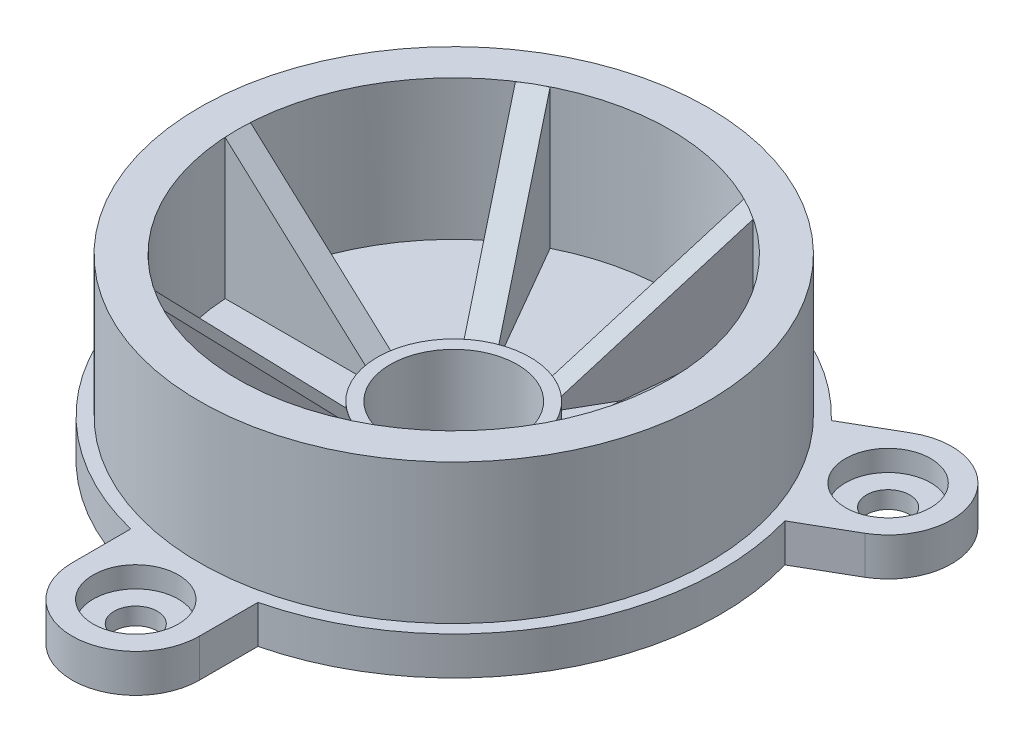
ISO-10303-21;
HEADER;
FILE_DESCRIPTION(('STEP AP214'),'2;1');
FILE_NAME('part.step','',(''),(''),'','','');
FILE_SCHEMA(('AUTOMOTIVE_DESIGN { 1 0 10303 214 1 1 1 1 }'));
ENDSEC;
DATA;
#1=APPLICATION_CONTEXT('core data for automotive mechanical design processes');
#2=APPLICATION_PROTOCOL_DEFINITION('international standard','automotive_design',2000,#1);
#3=PRODUCT_CONTEXT('',#1,'mechanical');
#4=PRODUCT('Part','Part','',(#3));
#5=PRODUCT_RELATED_PRODUCT_CATEGORY('part','',(#4));
#6=PRODUCT_DEFINITION_FORMATION('','',#4);
#7=PRODUCT_DEFINITION_CONTEXT('part definition',#1,'design');
#8=PRODUCT_DEFINITION('design','',#6,#7);
#9=PRODUCT_DEFINITION_SHAPE('','',#8);
#10=(LENGTH_UNIT() NAMED_UNIT(*) SI_UNIT(.MILLI.,.METRE.));
#11=(NAMED_UNIT(*) PLANE_ANGLE_UNIT() SI_UNIT($,.RADIAN.));
#12=(NAMED_UNIT(*) SI_UNIT($,.STERADIAN.) SOLID_ANGLE_UNIT());
#13=UNCERTAINTY_MEASURE_WITH_UNIT(LENGTH_MEASURE(1.E-05),#10,'distance_accuracy_value','');
#14=(GEOMETRIC_REPRESENTATION_CONTEXT(3) GLOBAL_UNCERTAINTY_ASSIGNED_CONTEXT((#13)) GLOBAL_UNIT_ASSIGNED_CONTEXT((#10,
#11,#12)) REPRESENTATION_CONTEXT('',''));
#15=CARTESIAN_POINT('',(0.,0.,0.));
#16=DIRECTION('',(0.,0.,1.));
#17=DIRECTION('',(1.,0.,0.));
#18=AXIS2_PLACEMENT_3D('',#15,#16,#17);
#19=CARTESIAN_POINT('',(0.,5.,-17.));
#20=DIRECTION('',(0.,1.,0.));
#21=DIRECTION('',(0.,0.,1.));
#22=AXIS2_PLACEMENT_3D('',#19,#20,#21);
#23=PLANE('',#22);
#24=CARTESIAN_POINT('',(0.,5.,0.));
#25=DIRECTION('',(0.,-1.,0.));
#26=DIRECTION('',(0.,0.,-1.));
#27=AXIS2_PLACEMENT_3D('',#24,#25,#26);
#28=CIRCLE('',#27,17.);
#29=CARTESIAN_POINT('',(-9.35130677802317,5.,14.196938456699));
#30=VERTEX_POINT('',#29);
#31=CARTESIAN_POINT('',(-16.9705627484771,5.,1.));
#32=VERTEX_POINT('',#31);
#33=EDGE_CURVE('E565',#30,#32,#28,.T.);
#34=ORIENTED_EDGE('',*,*,#33,.F.);
#35=DIRECTION('',(0.50000000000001,0.,-0.866025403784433));
#36=VECTOR('',#35,1.);
#37=CARTESIAN_POINT('',(6.4951905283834,5.,-13.2499999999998));
#38=LINE('',#37,#36);
#39=CARTESIAN_POINT('',(-3.8240652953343,5.,4.62347538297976));
#40=VERTEX_POINT('',#39);
#41=EDGE_CURVE('E300',#30,#40,#38,.T.);
#42=ORIENTED_EDGE('',*,*,#41,.T.);
#43=CARTESIAN_POINT('',(0.,5.,0.));
#44=DIRECTION('',(0.,-1.,0.));
#45=DIRECTION('',(0.,0.,-1.));
#46=AXIS2_PLACEMENT_3D('',#43,#44,#45);
#47=CIRCLE('',#46,6.);
#48=CARTESIAN_POINT('',(-5.91607978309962,5.,1.));
#49=VERTEX_POINT('',#48);
#50=EDGE_CURVE('E560',#40,#49,#47,.T.);
#51=ORIENTED_EDGE('',*,*,#50,.T.);
#52=DIRECTION('',(1.,0.,0.));
#53=VECTOR('',#52,1.);
#54=CARTESIAN_POINT('',(0.,5.,1.));
#55=LINE('',#54,#53);
#56=EDGE_CURVE('E433',#32,#49,#55,.T.);
#57=ORIENTED_EDGE('',*,*,#56,.F.);
#58=EDGE_LOOP('',(#34,#42,#51,#57));
#59=FACE_BOUND('',#58,.T.);
#60=ADVANCED_FACE('F31',(#59),#23,.T.);
#61=CARTESIAN_POINT('',(0.,0.,0.));
#62=DIRECTION('',(0.,-1.,0.));
#63=DIRECTION('',(0.,0.,-1.));
#64=AXIS2_PLACEMENT_3D('',#61,#62,#63);
#65=CYLINDRICAL_SURFACE('',#64,17.);
#66=DIRECTION('',(0.,-1.,0.));
#67=VECTOR('',#66,1.);
#68=CARTESIAN_POINT('',(-7.61925597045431,0.,15.196938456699));
#69=LINE('',#68,#67);
#70=CARTESIAN_POINT('',(-7.61925597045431,15.9732388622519,15.196938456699));
#71=VERTEX_POINT('',#70);
#72=CARTESIAN_POINT('',(-7.61925597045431,5.,15.196938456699));
#73=VERTEX_POINT('',#72);
#74=EDGE_CURVE('E327',#71,#73,#69,.T.);
#75=ORIENTED_EDGE('',*,*,#74,.F.);
#76=CARTESIAN_POINT('',(0.,0.545454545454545,0.));
#77=DIRECTION('',(-0.336336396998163,-0.739940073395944,0.582551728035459));
#78=DIRECTION('',(0.369970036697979,-0.672672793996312,-0.640806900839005));
#79=AXIS2_PLACEMENT_3D('',#76,#77,#78);
#80=ELLIPSE('',#79,22.9748335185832,17.);
#81=CARTESIAN_POINT('',(-8.50000000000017,16.,14.7224318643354));
#82=VERTEX_POINT('',#81);
#83=EDGE_CURVE('E320',#82,#71,#80,.F.);
#84=ORIENTED_EDGE('',*,*,#83,.F.);
#85=CARTESIAN_POINT('',(0.,16.,0.));
#86=DIRECTION('',(0.,-1.,0.));
#87=DIRECTION('',(0.,0.,-1.));
#88=AXIS2_PLACEMENT_3D('',#85,#86,#87);
#89=CIRCLE('',#88,17.);
#90=CARTESIAN_POINT('',(8.49999999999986,16.,14.7224318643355));
#91=VERTEX_POINT('',#90);
#92=EDGE_CURVE('E733',#91,#82,#89,.T.);
#93=ORIENTED_EDGE('',*,*,#92,.F.);
#94=CARTESIAN_POINT('',(0.,0.545454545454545,0.));
#95=DIRECTION('',(0.336336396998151,-0.739940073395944,0.582551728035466));
#96=DIRECTION('',(-0.369970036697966,-0.672672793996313,-0.640806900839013));
#97=AXIS2_PLACEMENT_3D('',#94,#95,#96);
#98=ELLIPSE('',#97,22.9748335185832,17.);
#99=CARTESIAN_POINT('',(7.61925597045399,15.9732388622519,15.1969384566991));
#100=VERTEX_POINT('',#99);
#101=EDGE_CURVE('E338',#100,#91,#98,.F.);
#102=ORIENTED_EDGE('',*,*,#101,.F.);
#103=DIRECTION('',(0.,-1.,0.));
#104=VECTOR('',#103,1.);
#105=CARTESIAN_POINT('',(7.61925597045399,0.,15.1969384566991));
#106=LINE('',#105,#104);
#107=CARTESIAN_POINT('',(7.61925597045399,5.,15.1969384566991));
#108=VERTEX_POINT('',#107);
#109=EDGE_CURVE('E342',#100,#108,#106,.T.);
#110=ORIENTED_EDGE('',*,*,#109,.T.);
#111=EDGE_CURVE('E636',#108,#73,#28,.T.);
#112=ORIENTED_EDGE('',*,*,#111,.T.);
#113=EDGE_LOOP('',(#75,#84,#93,#102,#110,#112));
#114=FACE_BOUND('',#113,.T.);
#115=ADVANCED_FACE('F749',(#114),#65,.F.);
#116=CARTESIAN_POINT('',(0.,0.,0.));
#117=DIRECTION('',(0.,-1.,0.));
#118=DIRECTION('',(0.,0.,-1.));
#119=AXIS2_PLACEMENT_3D('',#116,#117,#118);
#120=CYLINDRICAL_SURFACE('',#119,6.);
#121=DIRECTION('',(0.,-1.,0.));
#122=VECTOR('',#121,1.);
#123=CARTESIAN_POINT('',(-2.09201448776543,0.,5.62347538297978));
#124=LINE('',#123,#122);
#125=CARTESIAN_POINT('',(-2.09201448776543,5.,5.62347538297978));
#126=VERTEX_POINT('',#125);
#127=CARTESIAN_POINT('',(-2.09201448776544,5.92370889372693,5.62347538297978));
#128=VERTEX_POINT('',#127);
#129=EDGE_CURVE('E11',#126,#128,#124,.F.);
#130=ORIENTED_EDGE('',*,*,#129,.F.);
#131=CARTESIAN_POINT('',(2.09201448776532,5.,5.62347538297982));
#132=VERTEX_POINT('',#131);
#133=EDGE_CURVE('E760',#132,#126,#47,.T.);
#134=ORIENTED_EDGE('',*,*,#133,.F.);
#135=DIRECTION('',(0.,-1.,0.));
#136=VECTOR('',#135,1.);
#137=CARTESIAN_POINT('',(2.09201448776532,0.,5.62347538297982));
#138=LINE('',#137,#136);
#139=CARTESIAN_POINT('',(2.09201448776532,5.92370889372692,5.62347538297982));
#140=VERTEX_POINT('',#139);
#141=EDGE_CURVE('E624',#132,#140,#138,.F.);
#142=ORIENTED_EDGE('',*,*,#141,.T.);
#143=CARTESIAN_POINT('',(0.,0.545454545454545,0.));
#144=DIRECTION('',(0.336336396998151,-0.739940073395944,0.582551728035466));
#145=DIRECTION('',(-0.369970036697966,-0.672672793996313,-0.640806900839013));
#146=AXIS2_PLACEMENT_3D('',#143,#144,#145);
#147=ELLIPSE('',#146,8.10876477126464,6.);
#148=CARTESIAN_POINT('',(2.99999999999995,6.,5.19615242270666));
#149=VERTEX_POINT('',#148);
#150=EDGE_CURVE('E332',#149,#140,#147,.T.);
#151=ORIENTED_EDGE('',*,*,#150,.F.);
#152=CARTESIAN_POINT('',(0.,6.,0.));
#153=DIRECTION('',(0.,-1.,0.));
#154=DIRECTION('',(0.,0.,-1.));
#155=AXIS2_PLACEMENT_3D('',#152,#153,#154);
#156=CIRCLE('',#155,6.);
#157=CARTESIAN_POINT('',(-3.00000000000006,6.,5.1961524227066));
#158=VERTEX_POINT('',#157);
#159=EDGE_CURVE('E692',#149,#158,#156,.T.);
#160=ORIENTED_EDGE('',*,*,#159,.T.);
#161=CARTESIAN_POINT('',(0.,0.545454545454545,0.));
#162=DIRECTION('',(-0.336336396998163,-0.739940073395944,0.582551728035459));
#163=DIRECTION('',(0.369970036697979,-0.672672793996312,-0.640806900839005));
#164=AXIS2_PLACEMENT_3D('',#161,#162,#163);
#165=ELLIPSE('',#164,8.10876477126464,6.);
#166=EDGE_CURVE('E323',#128,#158,#165,.T.);
#167=ORIENTED_EDGE('',*,*,#166,.F.);
#168=EDGE_LOOP('',(#130,#134,#142,#151,#160,#167));
#169=FACE_BOUND('',#168,.T.);
#170=ADVANCED_FACE('F757',(#169),#120,.T.);
#171=DIRECTION('',(0.50000000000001,0.,-0.866025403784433));
#172=VECTOR('',#171,1.);
#173=CARTESIAN_POINT('',(8.22724133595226,5.,-12.2499999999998));
#174=LINE('',#173,#172);
#175=EDGE_CURVE('E304',#73,#126,#174,.T.);
#176=ORIENTED_EDGE('',*,*,#175,.F.);
#177=ORIENTED_EDGE('',*,*,#111,.F.);
#178=DIRECTION('',(-0.499999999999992,0.,-0.866025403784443));
#179=VECTOR('',#178,1.);
#180=CARTESIAN_POINT('',(-8.22724133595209,5.,-12.2500000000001));
#181=LINE('',#180,#179);
#182=EDGE_CURVE('E339',#108,#132,#181,.T.);
#183=ORIENTED_EDGE('',*,*,#182,.T.);
#184=ORIENTED_EDGE('',*,*,#133,.T.);
#185=EDGE_LOOP('',(#176,#177,#183,#184));
#186=FACE_BOUND('',#185,.T.);
#187=ADVANCED_FACE('F762',(#186),#23,.T.);
#188=DIRECTION('',(0.,-1.,0.));
#189=VECTOR('',#188,1.);
#190=CARTESIAN_POINT('',(9.35130677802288,0.,14.1969384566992));
#191=LINE('',#190,#189);
#192=CARTESIAN_POINT('',(9.35130677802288,15.9732388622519,14.1969384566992));
#193=VERTEX_POINT('',#192);
#194=CARTESIAN_POINT('',(9.35130677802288,5.,14.1969384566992));
#195=VERTEX_POINT('',#194);
#196=EDGE_CURVE('E347',#193,#195,#191,.T.);
#197=ORIENTED_EDGE('',*,*,#196,.F.);
#198=EDGE_CURVE('E336',#91,#193,#98,.F.);
#199=ORIENTED_EDGE('',*,*,#198,.F.);
#200=CARTESIAN_POINT('',(17.,16.,1.18710434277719E-13));
#201=VERTEX_POINT('',#200);
#202=EDGE_CURVE('E734',#201,#91,#89,.T.);
#203=ORIENTED_EDGE('',*,*,#202,.F.);
#204=CARTESIAN_POINT('',(0.,0.545454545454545,0.));
#205=DIRECTION('',(0.672672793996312,-0.739940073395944,0.));
#206=DIRECTION('',(-0.739940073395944,-0.672672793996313,0.));
#207=AXIS2_PLACEMENT_3D('',#204,#205,#206);
#208=ELLIPSE('',#207,22.9748335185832,17.);
#209=CARTESIAN_POINT('',(16.9705627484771,15.9732388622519,1.00000000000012));
#210=VERTEX_POINT('',#209);
#211=EDGE_CURVE('E360',#210,#201,#208,.F.);
#212=ORIENTED_EDGE('',*,*,#211,.F.);
#213=DIRECTION('',(0.,-1.,0.));
#214=VECTOR('',#213,1.);
#215=CARTESIAN_POINT('',(16.9705627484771,0.,1.00000000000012));
#216=LINE('',#215,#214);
#217=CARTESIAN_POINT('',(16.9705627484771,5.,1.00000000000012));
#218=VERTEX_POINT('',#217);
#219=EDGE_CURVE('E364',#210,#218,#216,.T.);
#220=ORIENTED_EDGE('',*,*,#219,.T.);
#221=EDGE_CURVE('E638',#218,#195,#28,.T.);
#222=ORIENTED_EDGE('',*,*,#221,.T.);
#223=EDGE_LOOP('',(#197,#199,#203,#212,#220,#222));
#224=FACE_BOUND('',#223,.T.);
#225=ADVANCED_FACE('F745',(#224),#65,.F.);
#226=DIRECTION('',(0.,-1.,0.));
#227=VECTOR('',#226,1.);
#228=CARTESIAN_POINT('',(3.8240652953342,0.,4.62347538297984));
#229=LINE('',#228,#227);
#230=CARTESIAN_POINT('',(3.8240652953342,5.,4.62347538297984));
#231=VERTEX_POINT('',#230);
#232=CARTESIAN_POINT('',(3.8240652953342,5.92370889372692,4.62347538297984));
#233=VERTEX_POINT('',#232);
#234=EDGE_CURVE('E627',#231,#233,#229,.F.);
#235=ORIENTED_EDGE('',*,*,#234,.F.);
#236=CARTESIAN_POINT('',(5.91607978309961,5.,1.00000000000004));
#237=VERTEX_POINT('',#236);
#238=EDGE_CURVE('E763',#237,#231,#47,.T.);
#239=ORIENTED_EDGE('',*,*,#238,.F.);
#240=DIRECTION('',(0.,-1.,0.));
#241=VECTOR('',#240,1.);
#242=CARTESIAN_POINT('',(5.91607978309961,0.,1.00000000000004));
#243=LINE('',#242,#241);
#244=CARTESIAN_POINT('',(5.91607978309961,5.92370889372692,1.00000000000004));
#245=VERTEX_POINT('',#244);
#246=EDGE_CURVE('E619',#237,#245,#243,.F.);
#247=ORIENTED_EDGE('',*,*,#246,.T.);
#248=CARTESIAN_POINT('',(0.,0.545454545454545,0.));
#249=DIRECTION('',(0.672672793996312,-0.739940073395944,0.));
#250=DIRECTION('',(-0.739940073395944,-0.672672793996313,0.));
#251=AXIS2_PLACEMENT_3D('',#248,#249,#250);
#252=ELLIPSE('',#251,8.10876477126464,6.);
#253=CARTESIAN_POINT('',(6.,6.,0.));
#254=VERTEX_POINT('',#253);
#255=EDGE_CURVE('E353',#254,#245,#252,.T.);
#256=ORIENTED_EDGE('',*,*,#255,.F.);
#257=EDGE_CURVE('E691',#254,#149,#156,.T.);
#258=ORIENTED_EDGE('',*,*,#257,.T.);
#259=EDGE_CURVE('E335',#233,#149,#147,.T.);
#260=ORIENTED_EDGE('',*,*,#259,.F.);
#261=EDGE_LOOP('',(#235,#239,#247,#256,#258,#260));
#262=FACE_BOUND('',#261,.T.);
#263=ADVANCED_FACE('F778',(#262),#120,.T.);
#264=DIRECTION('',(-0.499999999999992,0.,-0.866025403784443));
#265=VECTOR('',#264,1.);
#266=CARTESIAN_POINT('',(-6.49519052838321,5.,-13.2500000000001));
#267=LINE('',#266,#265);
#268=EDGE_CURVE('E345',#195,#231,#267,.T.);
#269=ORIENTED_EDGE('',*,*,#268,.F.);
#270=ORIENTED_EDGE('',*,*,#221,.F.);
#271=DIRECTION('',(-1.,0.,0.));
#272=VECTOR('',#271,1.);
#273=CARTESIAN_POINT('',(-1.25693400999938E-13,5.,1.));
#274=LINE('',#273,#272);
#275=EDGE_CURVE('E361',#218,#237,#274,.T.);
#276=ORIENTED_EDGE('',*,*,#275,.T.);
#277=ORIENTED_EDGE('',*,*,#238,.T.);
#278=EDGE_LOOP('',(#269,#270,#276,#277));
#279=FACE_BOUND('',#278,.T.);
#280=ADVANCED_FACE('F781',(#279),#23,.T.);
#281=DIRECTION('',(0.,-1.,0.));
#282=VECTOR('',#281,1.);
#283=CARTESIAN_POINT('',(16.9705627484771,0.,-0.999999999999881));
#284=LINE('',#283,#282);
#285=CARTESIAN_POINT('',(16.9705627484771,15.9732388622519,-0.999999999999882));
#286=VERTEX_POINT('',#285);
#287=CARTESIAN_POINT('',(16.9705627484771,5.,-0.999999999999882));
#288=VERTEX_POINT('',#287);
#289=EDGE_CURVE('E369',#286,#288,#284,.T.);
#290=ORIENTED_EDGE('',*,*,#289,.F.);
#291=EDGE_CURVE('E358',#201,#286,#208,.F.);
#292=ORIENTED_EDGE('',*,*,#291,.F.);
#293=CARTESIAN_POINT('',(8.50000000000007,16.,-14.7224318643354));
#294=VERTEX_POINT('',#293);
#295=EDGE_CURVE('E735',#294,#201,#89,.T.);
#296=ORIENTED_EDGE('',*,*,#295,.F.);
#297=CARTESIAN_POINT('',(0.,0.545454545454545,0.));
#298=DIRECTION('',(0.336336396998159,-0.739940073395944,-0.582551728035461));
#299=DIRECTION('',(-0.369970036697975,-0.672672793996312,0.640806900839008));
#300=AXIS2_PLACEMENT_3D('',#297,#298,#299);
#301=ELLIPSE('',#300,22.9748335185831,17.);
#302=CARTESIAN_POINT('',(9.35130677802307,15.9732388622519,-14.196938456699));
#303=VERTEX_POINT('',#302);
#304=EDGE_CURVE('E382',#303,#294,#301,.F.);
#305=ORIENTED_EDGE('',*,*,#304,.F.);
#306=DIRECTION('',(0.,-1.,0.));
#307=VECTOR('',#306,1.);
#308=CARTESIAN_POINT('',(9.35130677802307,0.,-14.196938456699));
#309=LINE('',#308,#307);
#310=CARTESIAN_POINT('',(9.35130677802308,5.,-14.196938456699));
#311=VERTEX_POINT('',#310);
#312=EDGE_CURVE('E386',#303,#311,#309,.T.);
#313=ORIENTED_EDGE('',*,*,#312,.T.);
#314=EDGE_CURVE('E643',#311,#288,#28,.T.);
#315=ORIENTED_EDGE('',*,*,#314,.T.);
#316=EDGE_LOOP('',(#290,#292,#296,#305,#313,#315));
#317=FACE_BOUND('',#316,.T.);
#318=ADVANCED_FACE('F740',(#317),#65,.F.);
#319=DIRECTION('',(0.,-1.,0.));
#320=VECTOR('',#319,1.);
#321=CARTESIAN_POINT('',(5.91607978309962,0.,-0.999999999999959));
#322=LINE('',#321,#320);
#323=CARTESIAN_POINT('',(5.91607978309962,5.,-0.999999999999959));
#324=VERTEX_POINT('',#323);
#325=CARTESIAN_POINT('',(5.91607978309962,5.92370889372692,-0.999999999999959));
#326=VERTEX_POINT('',#325);
#327=EDGE_CURVE('E622',#324,#326,#322,.F.);
#328=ORIENTED_EDGE('',*,*,#327,.F.);
#329=CARTESIAN_POINT('',(3.82406529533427,5.,-4.62347538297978));
#330=VERTEX_POINT('',#329);
#331=EDGE_CURVE('E765',#330,#324,#47,.T.);
#332=ORIENTED_EDGE('',*,*,#331,.F.);
#333=DIRECTION('',(0.,-1.,0.));
#334=VECTOR('',#333,1.);
#335=CARTESIAN_POINT('',(3.82406529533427,0.,-4.62347538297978));
#336=LINE('',#335,#334);
#337=CARTESIAN_POINT('',(3.82406529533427,5.92370889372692,-4.62347538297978));
#338=VERTEX_POINT('',#337);
#339=EDGE_CURVE('E614',#330,#338,#336,.F.);
#340=ORIENTED_EDGE('',*,*,#339,.T.);
#341=CARTESIAN_POINT('',(0.,0.545454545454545,0.));
#342=DIRECTION('',(0.336336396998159,-0.739940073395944,-0.582551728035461));
#343=DIRECTION('',(-0.369970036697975,-0.672672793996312,0.640806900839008));
#344=AXIS2_PLACEMENT_3D('',#341,#342,#343);
#345=ELLIPSE('',#344,8.10876477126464,6.);
#346=CARTESIAN_POINT('',(3.00000000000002,6.,-5.19615242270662));
#347=VERTEX_POINT('',#346);
#348=EDGE_CURVE('E375',#347,#338,#345,.T.);
#349=ORIENTED_EDGE('',*,*,#348,.F.);
#350=EDGE_CURVE('E683',#347,#254,#156,.T.);
#351=ORIENTED_EDGE('',*,*,#350,.T.);
#352=EDGE_CURVE('E357',#326,#254,#252,.T.);
#353=ORIENTED_EDGE('',*,*,#352,.F.);
#354=EDGE_LOOP('',(#328,#332,#340,#349,#351,#353));
#355=FACE_BOUND('',#354,.T.);
#356=ADVANCED_FACE('F681',(#355),#120,.T.);
#357=DIRECTION('',(-1.,0.,0.));
#358=VECTOR('',#357,1.);
#359=CARTESIAN_POINT('',(-1.117274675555E-13,5.,-1.));
#360=LINE('',#359,#358);
#361=EDGE_CURVE('E367',#288,#324,#360,.T.);
#362=ORIENTED_EDGE('',*,*,#361,.F.);
#363=ORIENTED_EDGE('',*,*,#314,.F.);
#364=DIRECTION('',(-0.500000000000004,0.,0.866025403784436));
#365=VECTOR('',#364,1.);
#366=CARTESIAN_POINT('',(8.2272413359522,5.,-12.2499999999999));
#367=LINE('',#366,#365);
#368=EDGE_CURVE('E383',#311,#330,#367,.T.);
#369=ORIENTED_EDGE('',*,*,#368,.T.);
#370=ORIENTED_EDGE('',*,*,#331,.T.);
#371=EDGE_LOOP('',(#362,#363,#369,#370));
#372=FACE_BOUND('',#371,.T.);
#373=ADVANCED_FACE('F772',(#372),#23,.T.);
#374=DIRECTION('',(0.,-1.,0.));
#375=VECTOR('',#374,1.);
#376=CARTESIAN_POINT('',(7.6192559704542,0.,-15.196938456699));
#377=LINE('',#376,#375);
#378=CARTESIAN_POINT('',(7.6192559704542,15.9732388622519,-15.196938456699));
#379=VERTEX_POINT('',#378);
#380=CARTESIAN_POINT('',(7.6192559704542,5.,-15.196938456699));
#381=VERTEX_POINT('',#380);
#382=EDGE_CURVE('E391',#379,#381,#377,.T.);
#383=ORIENTED_EDGE('',*,*,#382,.F.);
#384=EDGE_CURVE('E380',#294,#379,#301,.F.);
#385=ORIENTED_EDGE('',*,*,#384,.F.);
#386=CARTESIAN_POINT('',(-8.49999999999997,16.,-14.7224318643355));
#387=VERTEX_POINT('',#386);
#388=EDGE_CURVE('E575',#387,#294,#89,.T.);
#389=ORIENTED_EDGE('',*,*,#388,.F.);
#390=CARTESIAN_POINT('',(0.,0.545454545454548,0.));
#391=DIRECTION('',(-0.336336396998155,-0.739940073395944,-0.582551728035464));
#392=DIRECTION('',(0.36997003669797,-0.672672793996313,0.64080690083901));
#393=AXIS2_PLACEMENT_3D('',#390,#391,#392);
#394=ELLIPSE('',#393,22.9748335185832,17.);
#395=CARTESIAN_POINT('',(-7.6192559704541,15.9732388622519,-15.1969384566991));
#396=VERTEX_POINT('',#395);
#397=EDGE_CURVE('E404',#396,#387,#394,.F.);
#398=ORIENTED_EDGE('',*,*,#397,.F.);
#399=DIRECTION('',(0.,-1.,0.));
#400=VECTOR('',#399,1.);
#401=CARTESIAN_POINT('',(-7.61925597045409,0.,-15.1969384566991));
#402=LINE('',#401,#400);
#403=CARTESIAN_POINT('',(-7.61925597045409,5.,-15.1969384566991));
#404=VERTEX_POINT('',#403);
#405=EDGE_CURVE('E408',#396,#404,#402,.T.);
#406=ORIENTED_EDGE('',*,*,#405,.T.);
#407=EDGE_CURVE('E570',#404,#381,#28,.T.);
#408=ORIENTED_EDGE('',*,*,#407,.T.);
#409=EDGE_LOOP('',(#383,#385,#389,#398,#406,#408));
#410=FACE_BOUND('',#409,.T.);
#411=ADVANCED_FACE('F655',(#410),#65,.F.);
#412=DIRECTION('',(0.,-1.,0.));
#413=VECTOR('',#412,1.);
#414=CARTESIAN_POINT('',(2.09201448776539,0.,-5.62347538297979));
#415=LINE('',#414,#413);
#416=CARTESIAN_POINT('',(2.09201448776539,5.,-5.62347538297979));
#417=VERTEX_POINT('',#416);
#418=CARTESIAN_POINT('',(2.0920144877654,5.92370889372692,-5.62347538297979));
#419=VERTEX_POINT('',#418);
#420=EDGE_CURVE('E617',#417,#419,#415,.F.);
#421=ORIENTED_EDGE('',*,*,#420,.F.);
#422=CARTESIAN_POINT('',(-2.09201448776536,5.,-5.6234753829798));
#423=VERTEX_POINT('',#422);
#424=EDGE_CURVE('E566',#423,#417,#47,.T.);
#425=ORIENTED_EDGE('',*,*,#424,.F.);
#426=DIRECTION('',(0.,-1.,0.));
#427=VECTOR('',#426,1.);
#428=CARTESIAN_POINT('',(-2.09201448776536,0.,-5.6234753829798));
#429=LINE('',#428,#427);
#430=CARTESIAN_POINT('',(-2.09201448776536,5.92370889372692,-5.6234753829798));
#431=VERTEX_POINT('',#430);
#432=EDGE_CURVE('E609',#423,#431,#429,.F.);
#433=ORIENTED_EDGE('',*,*,#432,.T.);
#434=CARTESIAN_POINT('',(0.,0.545454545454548,0.));
#435=DIRECTION('',(-0.336336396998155,-0.739940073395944,-0.582551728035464));
#436=DIRECTION('',(0.36997003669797,-0.672672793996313,0.64080690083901));
#437=AXIS2_PLACEMENT_3D('',#434,#435,#436);
#438=ELLIPSE('',#437,8.10876477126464,6.);
#439=CARTESIAN_POINT('',(-2.99999999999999,6.,-5.19615242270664));
#440=VERTEX_POINT('',#439);
#441=EDGE_CURVE('E397',#440,#431,#438,.T.);
#442=ORIENTED_EDGE('',*,*,#441,.F.);
#443=EDGE_CURVE('E561',#440,#347,#156,.T.);
#444=ORIENTED_EDGE('',*,*,#443,.T.);
#445=EDGE_CURVE('E379',#419,#347,#345,.T.);
#446=ORIENTED_EDGE('',*,*,#445,.F.);
#447=EDGE_LOOP('',(#421,#425,#433,#442,#444,#446));
#448=FACE_BOUND('',#447,.T.);
#449=ADVANCED_FACE('F669',(#448),#120,.T.);
#450=DIRECTION('',(0.,-1.,0.));
#451=VECTOR('',#450,1.);
#452=CARTESIAN_POINT('',(-9.35130677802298,0.,-14.1969384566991));
#453=LINE('',#452,#451);
#454=CARTESIAN_POINT('',(-9.35130677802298,15.9732388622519,-14.1969384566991));
#455=VERTEX_POINT('',#454);
#456=CARTESIAN_POINT('',(-9.35130677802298,5.,-14.1969384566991));
#457=VERTEX_POINT('',#456);
#458=EDGE_CURVE('E413',#455,#457,#453,.T.);
#459=ORIENTED_EDGE('',*,*,#458,.F.);
#460=EDGE_CURVE('E402',#387,#455,#394,.F.);
#461=ORIENTED_EDGE('',*,*,#460,.F.);
#462=CARTESIAN_POINT('',(-17.,16.,0.));
#463=VERTEX_POINT('',#462);
#464=EDGE_CURVE('E571',#463,#387,#89,.T.);
#465=ORIENTED_EDGE('',*,*,#464,.F.);
#466=CARTESIAN_POINT('',(0.,0.545454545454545,0.));
#467=DIRECTION('',(-0.672672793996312,-0.739940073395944,0.));
#468=DIRECTION('',(0.739940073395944,-0.672672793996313,0.));
#469=AXIS2_PLACEMENT_3D('',#466,#467,#468);
#470=ELLIPSE('',#469,22.9748335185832,17.);
#471=CARTESIAN_POINT('',(-16.9705627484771,15.9732388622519,-1.));
#472=VERTEX_POINT('',#471);
#473=EDGE_CURVE('E426',#472,#463,#470,.F.);
#474=ORIENTED_EDGE('',*,*,#473,.F.);
#475=DIRECTION('',(0.,-1.,0.));
#476=VECTOR('',#475,1.);
#477=CARTESIAN_POINT('',(-16.9705627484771,0.,-1.));
#478=LINE('',#477,#476);
#479=CARTESIAN_POINT('',(-16.9705627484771,5.,-1.));
#480=VERTEX_POINT('',#479);
#481=EDGE_CURVE('E430',#472,#480,#478,.T.);
#482=ORIENTED_EDGE('',*,*,#481,.T.);
#483=EDGE_CURVE('E567',#480,#457,#28,.T.);
#484=ORIENTED_EDGE('',*,*,#483,.T.);
#485=EDGE_LOOP('',(#459,#461,#465,#474,#482,#484));
#486=FACE_BOUND('',#485,.T.);
#487=ADVANCED_FACE('F720',(#486),#65,.F.);
#488=DIRECTION('',(-0.500000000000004,0.,0.866025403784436));
#489=VECTOR('',#488,1.);
#490=CARTESIAN_POINT('',(6.49519052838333,5.,-13.2499999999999));
#491=LINE('',#490,#489);
#492=EDGE_CURVE('E389',#381,#417,#491,.T.);
#493=ORIENTED_EDGE('',*,*,#492,.F.);
#494=ORIENTED_EDGE('',*,*,#407,.F.);
#495=DIRECTION('',(0.499999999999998,0.,0.86602540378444));
#496=VECTOR('',#495,1.);
#497=CARTESIAN_POINT('',(-6.49519052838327,5.,-13.25));
#498=LINE('',#497,#496);
#499=EDGE_CURVE('E405',#404,#423,#498,.T.);
#500=ORIENTED_EDGE('',*,*,#499,.T.);
#501=ORIENTED_EDGE('',*,*,#424,.T.);
#502=EDGE_LOOP('',(#493,#494,#500,#501));
#503=FACE_BOUND('',#502,.T.);
#504=ADVANCED_FACE('F660',(#503),#23,.T.);
#505=DIRECTION('',(0.,-1.,0.));
#506=VECTOR('',#505,1.);
#507=CARTESIAN_POINT('',(-3.82406529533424,0.,-4.62347538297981));
#508=LINE('',#507,#506);
#509=CARTESIAN_POINT('',(-3.82406529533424,5.,-4.62347538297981));
#510=VERTEX_POINT('',#509);
#511=CARTESIAN_POINT('',(-3.82406529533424,5.92370889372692,-4.62347538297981));
#512=VERTEX_POINT('',#511);
#513=EDGE_CURVE('E612',#510,#512,#508,.F.);
#514=ORIENTED_EDGE('',*,*,#513,.F.);
#515=CARTESIAN_POINT('',(-5.91607978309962,5.,-1.));
#516=VERTEX_POINT('',#515);
#517=EDGE_CURVE('E562',#516,#510,#47,.T.);
#518=ORIENTED_EDGE('',*,*,#517,.F.);
#519=DIRECTION('',(0.,-1.,0.));
#520=VECTOR('',#519,1.);
#521=CARTESIAN_POINT('',(-5.91607978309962,0.,-1.));
#522=LINE('',#521,#520);
#523=CARTESIAN_POINT('',(-5.91607978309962,5.92370889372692,-1.));
#524=VERTEX_POINT('',#523);
#525=EDGE_CURVE('E598',#516,#524,#522,.F.);
#526=ORIENTED_EDGE('',*,*,#525,.T.);
#527=CARTESIAN_POINT('',(0.,0.545454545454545,0.));
#528=DIRECTION('',(-0.672672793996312,-0.739940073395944,0.));
#529=DIRECTION('',(0.739940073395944,-0.672672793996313,0.));
#530=AXIS2_PLACEMENT_3D('',#527,#528,#529);
#531=ELLIPSE('',#530,8.10876477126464,6.);
#532=CARTESIAN_POINT('',(-6.,6.,0.));
#533=VERTEX_POINT('',#532);
#534=EDGE_CURVE('E419',#533,#524,#531,.T.);
#535=ORIENTED_EDGE('',*,*,#534,.F.);
#536=EDGE_CURVE('E557',#533,#440,#156,.T.);
#537=ORIENTED_EDGE('',*,*,#536,.T.);
#538=EDGE_CURVE('E401',#512,#440,#438,.T.);
#539=ORIENTED_EDGE('',*,*,#538,.F.);
#540=EDGE_LOOP('',(#514,#518,#526,#535,#537,#539));
#541=FACE_BOUND('',#540,.T.);
#542=ADVANCED_FACE('F709',(#541),#120,.T.);
#543=CARTESIAN_POINT('',(0.,0.,0.));
#544=DIRECTION('',(0.,-1.,0.));
#545=DIRECTION('',(0.,0.,-1.));
#546=AXIS2_PLACEMENT_3D('',#543,#544,#545);
#547=CYLINDRICAL_SURFACE('',#546,21.);
#548=CARTESIAN_POINT('',(0.,5.,0.));
#549=DIRECTION('',(0.,-1.,0.));
#550=DIRECTION('',(0.,0.,-1.));
#551=AXIS2_PLACEMENT_3D('',#548,#549,#550);
#552=CIRCLE('',#551,21.);
#553=CARTESIAN_POINT('',(-15.1635217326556,5.,-14.5281660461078));
#554=VERTEX_POINT('',#553);
#555=CARTESIAN_POINT('',(15.1635217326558,5.,-14.5281660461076));
#556=VERTEX_POINT('',#555);
#557=EDGE_CURVE('E585',#554,#556,#552,.T.);
#558=ORIENTED_EDGE('',*,*,#557,.T.);
#559=DIRECTION('',(0.,1.,0.));
#560=VECTOR('',#559,1.);
#561=CARTESIAN_POINT('',(15.1635217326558,-14.3480654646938,-14.5281660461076));
#562=LINE('',#561,#560);
#563=CARTESIAN_POINT('',(15.1635217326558,2.,-14.5281660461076));
#564=VERTEX_POINT('',#563);
#565=EDGE_CURVE('E471',#564,#556,#562,.T.);
#566=ORIENTED_EDGE('',*,*,#565,.F.);
#567=CARTESIAN_POINT('',(0.,2.,0.));
#568=DIRECTION('',(0.,-1.,0.));
#569=DIRECTION('',(0.,0.,-1.));
#570=AXIS2_PLACEMENT_3D('',#567,#568,#569);
#571=CIRCLE('',#570,21.);
#572=CARTESIAN_POINT('',(-15.1635217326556,2.,-14.5281660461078));
#573=VERTEX_POINT('',#572);
#574=EDGE_CURVE('E589',#573,#564,#571,.T.);
#575=ORIENTED_EDGE('',*,*,#574,.F.);
#576=DIRECTION('',(0.,1.,0.));
#577=VECTOR('',#576,1.);
#578=CARTESIAN_POINT('',(-15.1635217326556,-14.3480654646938,-14.5281660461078));
#579=LINE('',#578,#577);
#580=EDGE_CURVE('E508',#573,#554,#579,.T.);
#581=ORIENTED_EDGE('',*,*,#580,.T.);
#582=EDGE_LOOP('',(#558,#566,#575,#581));
#583=FACE_BOUND('',#582,.T.);
#584=ADVANCED_FACE('F813',(#583),#547,.T.);
#585=CARTESIAN_POINT('',(-5.,5.,20.3960780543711));
#586=VERTEX_POINT('',#585);
#587=CARTESIAN_POINT('',(-20.1635217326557,5.,-5.86791200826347));
#588=VERTEX_POINT('',#587);
#589=EDGE_CURVE('E582',#586,#588,#552,.T.);
#590=ORIENTED_EDGE('',*,*,#589,.T.);
#591=DIRECTION('',(0.,1.,0.));
#592=VECTOR('',#591,1.);
#593=CARTESIAN_POINT('',(-20.1635217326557,-14.3480654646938,-5.86791200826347));
#594=LINE('',#593,#592);
#595=CARTESIAN_POINT('',(-20.1635217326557,2.,-5.86791200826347));
#596=VERTEX_POINT('',#595);
#597=EDGE_CURVE('E499',#596,#588,#594,.T.);
#598=ORIENTED_EDGE('',*,*,#597,.F.);
#599=CARTESIAN_POINT('',(-5.,2.,20.3960780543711));
#600=VERTEX_POINT('',#599);
#601=EDGE_CURVE('E586',#600,#596,#571,.T.);
#602=ORIENTED_EDGE('',*,*,#601,.F.);
#603=DIRECTION('',(0.,1.,0.));
#604=VECTOR('',#603,1.);
#605=CARTESIAN_POINT('',(-5.,-11.8648951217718,20.3960780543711));
#606=LINE('',#605,#604);
#607=EDGE_CURVE('E546',#600,#586,#606,.T.);
#608=ORIENTED_EDGE('',*,*,#607,.T.);
#609=EDGE_LOOP('',(#590,#598,#602,#608));
#610=FACE_BOUND('',#609,.T.);
#611=ADVANCED_FACE('F904',(#610),#547,.T.);
#612=CARTESIAN_POINT('',(0.,0.,0.));
#613=DIRECTION('',(0.,-1.,0.));
#614=DIRECTION('',(0.,0.,-1.));
#615=AXIS2_PLACEMENT_3D('',#612,#613,#614);
#616=CYLINDRICAL_SURFACE('',#615,5.);
#617=CARTESIAN_POINT('',(0.,0.,0.));
#618=DIRECTION('',(0.,-1.,0.));
#619=DIRECTION('',(0.,0.,-1.));
#620=AXIS2_PLACEMENT_3D('',#617,#618,#619);
#621=CIRCLE('',#620,5.);
#622=CARTESIAN_POINT('',(0.,0.,-5.));
#623=VERTEX_POINT('',#622);
#624=EDGE_CURVE('E595',#623,#623,#621,.T.);
#625=ORIENTED_EDGE('',*,*,#624,.T.);
#626=EDGE_LOOP('',(#625));
#627=FACE_BOUND('',#626,.T.);
#628=CARTESIAN_POINT('',(0.,6.,0.));
#629=DIRECTION('',(0.,-1.,0.));
#630=DIRECTION('',(0.,0.,-1.));
#631=AXIS2_PLACEMENT_3D('',#628,#629,#630);
#632=CIRCLE('',#631,5.);
#633=CARTESIAN_POINT('',(0.,6.,-5.));
#634=VERTEX_POINT('',#633);
#635=EDGE_CURVE('E553',#634,#634,#632,.T.);
#636=ORIENTED_EDGE('',*,*,#635,.F.);
#637=EDGE_LOOP('',(#636));
#638=FACE_BOUND('',#637,.T.);
#639=ADVANCED_FACE('F33',(#627,#638),#616,.F.);
#640=CARTESIAN_POINT('',(0.,0.,-5.));
#641=DIRECTION('',(0.,-1.,0.));
#642=DIRECTION('',(0.,0.,-1.));
#643=AXIS2_PLACEMENT_3D('',#640,#641,#642);
#644=PLANE('',#643);
#645=CARTESIAN_POINT('',(0.,0.,0.));
#646=DIRECTION('',(0.,-1.,0.));
#647=DIRECTION('',(0.,0.,-1.));
#648=AXIS2_PLACEMENT_3D('',#645,#646,#647);
#649=CIRCLE('',#648,10.);
#650=CARTESIAN_POINT('',(0.,0.,-10.));
#651=VERTEX_POINT('',#650);
#652=EDGE_CURVE('E592',#651,#651,#649,.T.);
#653=ORIENTED_EDGE('',*,*,#652,.T.);
#654=EDGE_LOOP('',(#653));
#655=FACE_BOUND('',#654,.T.);
#656=ORIENTED_EDGE('',*,*,#624,.F.);
#657=EDGE_LOOP('',(#656));
#658=FACE_BOUND('',#657,.T.);
#659=ADVANCED_FACE('F925',(#655,#658),#644,.T.);
#660=CARTESIAN_POINT('',(0.,0.,0.));
#661=DIRECTION('',(0.,-1.,0.));
#662=DIRECTION('',(0.,0.,-1.));
#663=AXIS2_PLACEMENT_3D('',#660,#661,#662);
#664=CYLINDRICAL_SURFACE('',#663,10.);
#665=CARTESIAN_POINT('',(0.,2.,0.));
#666=DIRECTION('',(0.,-1.,0.));
#667=DIRECTION('',(0.,0.,-1.));
#668=AXIS2_PLACEMENT_3D('',#665,#666,#667);
#669=CIRCLE('',#668,10.);
#670=CARTESIAN_POINT('',(0.,2.,-10.));
#671=VERTEX_POINT('',#670);
#672=EDGE_CURVE('E588',#671,#671,#669,.T.);
#673=ORIENTED_EDGE('',*,*,#672,.T.);
#674=EDGE_LOOP('',(#673));
#675=FACE_BOUND('',#674,.T.);
#676=ORIENTED_EDGE('',*,*,#652,.F.);
#677=EDGE_LOOP('',(#676));
#678=FACE_BOUND('',#677,.T.);
#679=ADVANCED_FACE('F934',(#675,#678),#664,.T.);
#680=CARTESIAN_POINT('',(0.,2.,-10.));
#681=DIRECTION('',(0.,-1.,0.));
#682=DIRECTION('',(0.,0.,-1.));
#683=AXIS2_PLACEMENT_3D('',#680,#681,#682);
#684=PLANE('',#683);
#685=ORIENTED_EDGE('',*,*,#601,.T.);
#686=DIRECTION('',(0.866025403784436,0.,0.500000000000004));
#687=VECTOR('',#686,1.);
#688=CARTESIAN_POINT('',(-20.1635217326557,2.,-5.86791200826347));
#689=LINE('',#688,#687);
#690=CARTESIAN_POINT('',(-24.1506350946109,2.,-8.16987298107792));
#691=VERTEX_POINT('',#690);
#692=EDGE_CURVE('E491',#691,#596,#689,.T.);
#693=ORIENTED_EDGE('',*,*,#692,.F.);
#694=CARTESIAN_POINT('',(-21.6506350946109,2.,-12.5000000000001));
#695=DIRECTION('',(0.,-1.,0.));
#696=DIRECTION('',(0.,0.,-1.));
#697=AXIS2_PLACEMENT_3D('',#694,#695,#696);
#698=CIRCLE('',#697,5.);
#699=CARTESIAN_POINT('',(-19.1506350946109,2.,-16.8301270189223));
#700=VERTEX_POINT('',#699);
#701=EDGE_CURVE('E500',#700,#691,#698,.F.);
#702=ORIENTED_EDGE('',*,*,#701,.F.);
#703=DIRECTION('',(-0.866025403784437,0.,-0.500000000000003));
#704=VECTOR('',#703,1.);
#705=CARTESIAN_POINT('',(-15.1635217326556,2.,-14.5281660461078));
#706=LINE('',#705,#704);
#707=EDGE_CURVE('E505',#573,#700,#706,.T.);
#708=ORIENTED_EDGE('',*,*,#707,.F.);
#709=ORIENTED_EDGE('',*,*,#574,.T.);
#710=DIRECTION('',(-0.866025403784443,0.,0.499999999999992));
#711=VECTOR('',#710,1.);
#712=CARTESIAN_POINT('',(15.1635217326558,2.,-14.5281660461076));
#713=LINE('',#712,#711);
#714=CARTESIAN_POINT('',(19.1506350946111,2.,-16.830127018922));
#715=VERTEX_POINT('',#714);
#716=EDGE_CURVE('E462',#715,#564,#713,.T.);
#717=ORIENTED_EDGE('',*,*,#716,.F.);
#718=CARTESIAN_POINT('',(21.6506350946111,2.,-12.4999999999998));
#719=DIRECTION('',(0.,-1.,0.));
#720=DIRECTION('',(0.,0.,-1.));
#721=AXIS2_PLACEMENT_3D('',#718,#719,#720);
#722=CIRCLE('',#721,5.);
#723=CARTESIAN_POINT('',(24.150635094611,2.,-8.16987298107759));
#724=VERTEX_POINT('',#723);
#725=EDGE_CURVE('E472',#724,#715,#722,.F.);
#726=ORIENTED_EDGE('',*,*,#725,.F.);
#727=DIRECTION('',(0.866025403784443,0.,-0.499999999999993));
#728=VECTOR('',#727,1.);
#729=CARTESIAN_POINT('',(20.1635217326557,2.,-5.86791200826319));
#730=LINE('',#729,#728);
#731=CARTESIAN_POINT('',(20.1635217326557,2.,-5.86791200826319));
#732=VERTEX_POINT('',#731);
#733=EDGE_CURVE('E477',#732,#724,#730,.T.);
#734=ORIENTED_EDGE('',*,*,#733,.F.);
#735=CARTESIAN_POINT('',(5.,2.,20.3960780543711));
#736=VERTEX_POINT('',#735);
#737=EDGE_CURVE('E584',#732,#736,#571,.T.);
#738=ORIENTED_EDGE('',*,*,#737,.T.);
#739=DIRECTION('',(0.,0.,-1.));
#740=VECTOR('',#739,1.);
#741=CARTESIAN_POINT('',(5.,2.,20.3960780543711));
#742=LINE('',#741,#740);
#743=CARTESIAN_POINT('',(5.,2.,25.));
#744=VERTEX_POINT('',#743);
#745=EDGE_CURVE('E528',#744,#736,#742,.T.);
#746=ORIENTED_EDGE('',*,*,#745,.F.);
#747=CARTESIAN_POINT('',(0.,2.,25.));
#748=DIRECTION('',(0.,-1.,0.));
#749=DIRECTION('',(0.,0.,-1.));
#750=AXIS2_PLACEMENT_3D('',#747,#748,#749);
#751=CIRCLE('',#750,5.);
#752=CARTESIAN_POINT('',(-5.,2.,25.));
#753=VERTEX_POINT('',#752);
#754=EDGE_CURVE('E538',#753,#744,#751,.F.);
#755=ORIENTED_EDGE('',*,*,#754,.F.);
#756=DIRECTION('',(0.,0.,1.));
#757=VECTOR('',#756,1.);
#758=CARTESIAN_POINT('',(-5.,2.,20.3960780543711));
#759=LINE('',#758,#757);
#760=EDGE_CURVE('E543',#600,#753,#759,.T.);
#761=ORIENTED_EDGE('',*,*,#760,.F.);
#762=EDGE_LOOP('',(#685,#693,#702,#708,#709,#717,#726,#734,#738,#746,#755,#761));
#763=FACE_BOUND('',#762,.T.);
#764=ORIENTED_EDGE('',*,*,#672,.F.);
#765=EDGE_LOOP('',(#764));
#766=FACE_BOUND('',#765,.T.);
#767=CARTESIAN_POINT('',(21.6506350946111,2.,-12.4999999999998));
#768=DIRECTION('',(0.,-1.,0.));
#769=DIRECTION('',(0.,0.,-1.));
#770=AXIS2_PLACEMENT_3D('',#767,#768,#769);
#771=CIRCLE('',#770,1.7);
#772=CARTESIAN_POINT('',(21.6506350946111,2.,-14.1999999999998));
#773=VERTEX_POINT('',#772);
#774=EDGE_CURVE('E448',#773,#773,#771,.T.);
#775=ORIENTED_EDGE('',*,*,#774,.F.);
#776=EDGE_LOOP('',(#775));
#777=FACE_BOUND('',#776,.T.);
#778=CARTESIAN_POINT('',(-21.6506350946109,2.,-12.5000000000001));
#779=DIRECTION('',(0.,-1.,0.));
#780=DIRECTION('',(0.,0.,-1.));
#781=AXIS2_PLACEMENT_3D('',#778,#779,#780);
#782=CIRCLE('',#781,1.7);
#783=CARTESIAN_POINT('',(-21.6506350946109,2.,-14.2000000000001));
#784=VERTEX_POINT('',#783);
#785=EDGE_CURVE('E458',#784,#784,#782,.T.);
#786=ORIENTED_EDGE('',*,*,#785,.F.);
#787=EDGE_LOOP('',(#786));
#788=FACE_BOUND('',#787,.T.);
#789=CARTESIAN_POINT('',(0.,2.,25.));
#790=DIRECTION('',(0.,-1.,0.));
#791=DIRECTION('',(0.,0.,-1.));
#792=AXIS2_PLACEMENT_3D('',#789,#790,#791);
#793=CIRCLE('',#792,1.7);
#794=CARTESIAN_POINT('',(0.,2.,23.3));
#795=VERTEX_POINT('',#794);
#796=EDGE_CURVE('E524',#795,#795,#793,.T.);
#797=ORIENTED_EDGE('',*,*,#796,.F.);
#798=EDGE_LOOP('',(#797));
#799=FACE_BOUND('',#798,.T.);
#800=ADVANCED_FACE('F943',(#763,#766,#777,#788,#799),#684,.T.);
#801=CARTESIAN_POINT('',(20.1635217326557,5.,-5.86791200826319));
#802=VERTEX_POINT('',#801);
#803=CARTESIAN_POINT('',(5.,5.,20.3960780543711));
#804=VERTEX_POINT('',#803);
#805=EDGE_CURVE('E581',#802,#804,#552,.T.);
#806=ORIENTED_EDGE('',*,*,#805,.T.);
#807=DIRECTION('',(0.,1.,0.));
#808=VECTOR('',#807,1.);
#809=CARTESIAN_POINT('',(5.,-11.8648951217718,20.3960780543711));
#810=LINE('',#809,#808);
#811=EDGE_CURVE('E537',#736,#804,#810,.T.);
#812=ORIENTED_EDGE('',*,*,#811,.F.);
#813=ORIENTED_EDGE('',*,*,#737,.F.);
#814=DIRECTION('',(0.,1.,0.));
#815=VECTOR('',#814,1.);
#816=CARTESIAN_POINT('',(20.1635217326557,-14.3480654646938,-5.86791200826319));
#817=LINE('',#816,#815);
#818=EDGE_CURVE('E480',#732,#802,#817,.T.);
#819=ORIENTED_EDGE('',*,*,#818,.T.);
#820=EDGE_LOOP('',(#806,#812,#813,#819));
#821=FACE_BOUND('',#820,.T.);
#822=ADVANCED_FACE('F907',(#821),#547,.T.);
#823=CARTESIAN_POINT('',(0.,5.,-21.));
#824=DIRECTION('',(0.,1.,0.));
#825=DIRECTION('',(0.,0.,1.));
#826=AXIS2_PLACEMENT_3D('',#823,#824,#825);
#827=PLANE('',#826);
#828=CARTESIAN_POINT('',(0.,5.,0.));
#829=DIRECTION('',(0.,-1.,0.));
#830=DIRECTION('',(0.,0.,-1.));
#831=AXIS2_PLACEMENT_3D('',#828,#829,#830);
#832=CIRCLE('',#831,20.);
#833=CARTESIAN_POINT('',(0.,5.,-20.));
#834=VERTEX_POINT('',#833);
#835=EDGE_CURVE('E578',#834,#834,#832,.T.);
#836=ORIENTED_EDGE('',*,*,#835,.T.);
#837=EDGE_LOOP('',(#836));
#838=FACE_BOUND('',#837,.T.);
#839=DIRECTION('',(0.866025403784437,0.,0.500000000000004));
#840=VECTOR('',#839,1.);
#841=CARTESIAN_POINT('',(-20.1635217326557,5.,-5.86791200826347));
#842=LINE('',#841,#840);
#843=CARTESIAN_POINT('',(-24.1506350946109,5.,-8.16987298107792));
#844=VERTEX_POINT('',#843);
#845=EDGE_CURVE('E492',#844,#588,#842,.T.);
#846=ORIENTED_EDGE('',*,*,#845,.T.);
#847=ORIENTED_EDGE('',*,*,#589,.F.);
#848=DIRECTION('',(0.,0.,1.));
#849=VECTOR('',#848,1.);
#850=CARTESIAN_POINT('',(-5.,5.,20.3960780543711));
#851=LINE('',#850,#849);
#852=CARTESIAN_POINT('',(-5.,5.,25.));
#853=VERTEX_POINT('',#852);
#854=EDGE_CURVE('E525',#586,#853,#851,.T.);
#855=ORIENTED_EDGE('',*,*,#854,.T.);
#856=CARTESIAN_POINT('',(0.,5.,25.));
#857=DIRECTION('',(0.,1.,0.));
#858=DIRECTION('',(0.,0.,1.));
#859=AXIS2_PLACEMENT_3D('',#856,#857,#858);
#860=CIRCLE('',#859,5.);
#861=CARTESIAN_POINT('',(5.,5.,25.));
#862=VERTEX_POINT('',#861);
#863=EDGE_CURVE('E532',#853,#862,#860,.T.);
#864=ORIENTED_EDGE('',*,*,#863,.T.);
#865=DIRECTION('',(0.,0.,-1.));
#866=VECTOR('',#865,1.);
#867=CARTESIAN_POINT('',(5.,5.,20.3960780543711));
#868=LINE('',#867,#866);
#869=EDGE_CURVE('E529',#862,#804,#868,.T.);
#870=ORIENTED_EDGE('',*,*,#869,.T.);
#871=ORIENTED_EDGE('',*,*,#805,.F.);
#872=DIRECTION('',(0.866025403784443,0.,-0.499999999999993));
#873=VECTOR('',#872,1.);
#874=CARTESIAN_POINT('',(20.1635217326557,5.,-5.86791200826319));
#875=LINE('',#874,#873);
#876=CARTESIAN_POINT('',(24.150635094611,5.,-8.16987298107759));
#877=VERTEX_POINT('',#876);
#878=EDGE_CURVE('E459',#802,#877,#875,.T.);
#879=ORIENTED_EDGE('',*,*,#878,.T.);
#880=CARTESIAN_POINT('',(21.6506350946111,5.,-12.4999999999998));
#881=DIRECTION('',(0.,1.,0.));
#882=DIRECTION('',(0.866025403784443,0.,-0.499999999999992));
#883=AXIS2_PLACEMENT_3D('',#880,#881,#882);
#884=CIRCLE('',#883,5.);
#885=CARTESIAN_POINT('',(19.1506350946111,5.,-16.830127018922));
#886=VERTEX_POINT('',#885);
#887=EDGE_CURVE('E466',#877,#886,#884,.T.);
#888=ORIENTED_EDGE('',*,*,#887,.T.);
#889=DIRECTION('',(-0.866025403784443,0.,0.499999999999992));
#890=VECTOR('',#889,1.);
#891=CARTESIAN_POINT('',(15.1635217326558,5.,-14.5281660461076));
#892=LINE('',#891,#890);
#893=EDGE_CURVE('E463',#886,#556,#892,.T.);
#894=ORIENTED_EDGE('',*,*,#893,.T.);
#895=ORIENTED_EDGE('',*,*,#557,.F.);
#896=DIRECTION('',(-0.866025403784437,0.,-0.500000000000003));
#897=VECTOR('',#896,1.);
#898=CARTESIAN_POINT('',(-15.1635217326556,5.,-14.5281660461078));
#899=LINE('',#898,#897);
#900=CARTESIAN_POINT('',(-19.1506350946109,5.,-16.8301270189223));
#901=VERTEX_POINT('',#900);
#902=EDGE_CURVE('E488',#554,#901,#899,.T.);
#903=ORIENTED_EDGE('',*,*,#902,.T.);
#904=CARTESIAN_POINT('',(-21.6506350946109,5.,-12.5000000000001));
#905=DIRECTION('',(0.,1.,0.));
#906=DIRECTION('',(-0.866025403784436,0.,-0.500000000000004));
#907=AXIS2_PLACEMENT_3D('',#904,#905,#906);
#908=CIRCLE('',#907,5.);
#909=EDGE_CURVE('E487',#901,#844,#908,.T.);
#910=ORIENTED_EDGE('',*,*,#909,.T.);
#911=EDGE_LOOP('',(#846,#847,#855,#864,#870,#871,#879,#888,#894,#895,#903,#910));
#912=FACE_BOUND('',#911,.T.);
#913=CARTESIAN_POINT('',(21.6506350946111,5.,-12.4999999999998));
#914=DIRECTION('',(0.,1.,0.));
#915=DIRECTION('',(0.,0.,1.));
#916=AXIS2_PLACEMENT_3D('',#913,#914,#915);
#917=CIRCLE('',#916,3.35);
#918=CARTESIAN_POINT('',(21.6506350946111,5.,-9.1499999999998));
#919=VERTEX_POINT('',#918);
#920=EDGE_CURVE('E439',#919,#919,#917,.T.);
#921=ORIENTED_EDGE('',*,*,#920,.F.);
#922=EDGE_LOOP('',(#921));
#923=FACE_BOUND('',#922,.T.);
#924=CARTESIAN_POINT('',(-21.6506350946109,5.,-12.5000000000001));
#925=DIRECTION('',(0.,1.,0.));
#926=DIRECTION('',(0.,0.,1.));
#927=AXIS2_PLACEMENT_3D('',#924,#925,#926);
#928=CIRCLE('',#927,3.35);
#929=CARTESIAN_POINT('',(-21.6506350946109,5.,-9.1500000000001));
#930=VERTEX_POINT('',#929);
#931=EDGE_CURVE('E449',#930,#930,#928,.T.);
#932=ORIENTED_EDGE('',*,*,#931,.F.);
#933=EDGE_LOOP('',(#932));
#934=FACE_BOUND('',#933,.T.);
#935=CARTESIAN_POINT('',(0.,5.,25.));
#936=DIRECTION('',(0.,1.,0.));
#937=DIRECTION('',(0.,0.,1.));
#938=AXIS2_PLACEMENT_3D('',#935,#936,#937);
#939=CIRCLE('',#938,3.35);
#940=CARTESIAN_POINT('',(0.,5.,28.35));
#941=VERTEX_POINT('',#940);
#942=EDGE_CURVE('E515',#941,#941,#939,.T.);
#943=ORIENTED_EDGE('',*,*,#942,.F.);
#944=EDGE_LOOP('',(#943));
#945=FACE_BOUND('',#944,.T.);
#946=ADVANCED_FACE('F964',(#838,#912,#923,#934,#945),#827,.T.);
#947=CARTESIAN_POINT('',(0.,0.,0.));
#948=DIRECTION('',(0.,-1.,0.));
#949=DIRECTION('',(0.,0.,-1.));
#950=AXIS2_PLACEMENT_3D('',#947,#948,#949);
#951=CYLINDRICAL_SURFACE('',#950,20.);
#952=CARTESIAN_POINT('',(0.,16.,0.));
#953=DIRECTION('',(0.,-1.,0.));
#954=DIRECTION('',(0.,0.,-1.));
#955=AXIS2_PLACEMENT_3D('',#952,#953,#954);
#956=CIRCLE('',#955,20.);
#957=CARTESIAN_POINT('',(0.,16.,-20.));
#958=VERTEX_POINT('',#957);
#959=EDGE_CURVE('E574',#958,#958,#956,.T.);
#960=ORIENTED_EDGE('',*,*,#959,.T.);
#961=EDGE_LOOP('',(#960));
#962=FACE_BOUND('',#961,.T.);
#963=ORIENTED_EDGE('',*,*,#835,.F.);
#964=EDGE_LOOP('',(#963));
#965=FACE_BOUND('',#964,.T.);
#966=ADVANCED_FACE('F973',(#962,#965),#951,.T.);
#967=CARTESIAN_POINT('',(0.,16.,-20.));
#968=DIRECTION('',(0.,1.,0.));
#969=DIRECTION('',(0.,0.,1.));
#970=AXIS2_PLACEMENT_3D('',#967,#968,#969);
#971=PLANE('',#970);
#972=ORIENTED_EDGE('',*,*,#92,.T.);
#973=EDGE_CURVE('E318',#82,#463,#89,.T.);
#974=ORIENTED_EDGE('',*,*,#973,.T.);
#975=ORIENTED_EDGE('',*,*,#464,.T.);
#976=ORIENTED_EDGE('',*,*,#388,.T.);
#977=ORIENTED_EDGE('',*,*,#295,.T.);
#978=ORIENTED_EDGE('',*,*,#202,.T.);
#979=EDGE_LOOP('',(#972,#974,#975,#976,#977,#978));
#980=FACE_BOUND('',#979,.T.);
#981=ORIENTED_EDGE('',*,*,#959,.F.);
#982=EDGE_LOOP('',(#981));
#983=FACE_BOUND('',#982,.T.);
#984=ADVANCED_FACE('F728',(#980,#983),#971,.T.);
#985=CARTESIAN_POINT('',(-9.35130677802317,15.9732388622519,14.196938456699));
#986=VERTEX_POINT('',#985);
#987=EDGE_CURVE('E308',#986,#82,#80,.F.);
#988=ORIENTED_EDGE('',*,*,#987,.F.);
#989=DIRECTION('',(0.,-1.,0.));
#990=VECTOR('',#989,1.);
#991=CARTESIAN_POINT('',(-9.35130677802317,0.,14.196938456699));
#992=LINE('',#991,#990);
#993=EDGE_CURVE('E297',#986,#30,#992,.T.);
#994=ORIENTED_EDGE('',*,*,#993,.T.);
#995=ORIENTED_EDGE('',*,*,#33,.T.);
#996=DIRECTION('',(0.,-1.,0.));
#997=VECTOR('',#996,1.);
#998=CARTESIAN_POINT('',(-16.9705627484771,0.,1.));
#999=LINE('',#998,#997);
#1000=CARTESIAN_POINT('',(-16.9705627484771,15.9732388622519,1.));
#1001=VERTEX_POINT('',#1000);
#1002=EDGE_CURVE('E436',#1001,#32,#999,.T.);
#1003=ORIENTED_EDGE('',*,*,#1002,.F.);
#1004=EDGE_CURVE('E424',#463,#1001,#470,.F.);
#1005=ORIENTED_EDGE('',*,*,#1004,.F.);
#1006=ORIENTED_EDGE('',*,*,#973,.F.);
#1007=EDGE_LOOP('',(#988,#994,#995,#1003,#1005,#1006));
#1008=FACE_BOUND('',#1007,.T.);
#1009=ADVANCED_FACE('F316',(#1008),#65,.F.);
#1010=DIRECTION('',(0.499999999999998,0.,0.86602540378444));
#1011=VECTOR('',#1010,1.);
#1012=CARTESIAN_POINT('',(-8.22724133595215,5.,-12.25));
#1013=LINE('',#1012,#1011);
#1014=EDGE_CURVE('E411',#457,#510,#1013,.T.);
#1015=ORIENTED_EDGE('',*,*,#1014,.F.);
#1016=ORIENTED_EDGE('',*,*,#483,.F.);
#1017=DIRECTION('',(1.,0.,0.));
#1018=VECTOR('',#1017,1.);
#1019=CARTESIAN_POINT('',(0.,5.,-1.));
#1020=LINE('',#1019,#1018);
#1021=EDGE_CURVE('E427',#480,#516,#1020,.T.);
#1022=ORIENTED_EDGE('',*,*,#1021,.T.);
#1023=ORIENTED_EDGE('',*,*,#517,.T.);
#1024=EDGE_LOOP('',(#1015,#1016,#1022,#1023));
#1025=FACE_BOUND('',#1024,.T.);
#1026=ADVANCED_FACE('F717',(#1025),#23,.T.);
#1027=CARTESIAN_POINT('',(-3.8240652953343,5.92370889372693,4.62347538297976));
#1028=VERTEX_POINT('',#1027);
#1029=EDGE_CURVE('E311',#158,#1028,#165,.T.);
#1030=ORIENTED_EDGE('',*,*,#1029,.F.);
#1031=EDGE_CURVE('E556',#158,#533,#156,.T.);
#1032=ORIENTED_EDGE('',*,*,#1031,.T.);
#1033=CARTESIAN_POINT('',(-5.91607978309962,5.92370889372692,1.));
#1034=VERTEX_POINT('',#1033);
#1035=EDGE_CURVE('E423',#1034,#533,#531,.T.);
#1036=ORIENTED_EDGE('',*,*,#1035,.F.);
#1037=DIRECTION('',(0.,-1.,0.));
#1038=VECTOR('',#1037,1.);
#1039=CARTESIAN_POINT('',(-5.91607978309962,0.,1.));
#1040=LINE('',#1039,#1038);
#1041=EDGE_CURVE('E607',#49,#1034,#1040,.F.);
#1042=ORIENTED_EDGE('',*,*,#1041,.F.);
#1043=ORIENTED_EDGE('',*,*,#50,.F.);
#1044=DIRECTION('',(0.,-1.,0.));
#1045=VECTOR('',#1044,1.);
#1046=CARTESIAN_POINT('',(-3.8240652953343,0.,4.62347538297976));
#1047=LINE('',#1046,#1045);
#1048=EDGE_CURVE('E39',#40,#1028,#1047,.F.);
#1049=ORIENTED_EDGE('',*,*,#1048,.T.);
#1050=EDGE_LOOP('',(#1030,#1032,#1036,#1042,#1043,#1049));
#1051=FACE_BOUND('',#1050,.T.);
#1052=ADVANCED_FACE('F630',(#1051),#120,.T.);
#1053=CARTESIAN_POINT('',(0.,6.,-6.));
#1054=DIRECTION('',(0.,1.,0.));
#1055=DIRECTION('',(0.,0.,1.));
#1056=AXIS2_PLACEMENT_3D('',#1053,#1054,#1055);
#1057=PLANE('',#1056);
#1058=ORIENTED_EDGE('',*,*,#635,.T.);
#1059=EDGE_LOOP('',(#1058));
#1060=FACE_BOUND('',#1059,.T.);
#1061=ORIENTED_EDGE('',*,*,#536,.F.);
#1062=ORIENTED_EDGE('',*,*,#1031,.F.);
#1063=ORIENTED_EDGE('',*,*,#159,.F.);
#1064=ORIENTED_EDGE('',*,*,#257,.F.);
#1065=ORIENTED_EDGE('',*,*,#350,.F.);
#1066=ORIENTED_EDGE('',*,*,#443,.F.);
#1067=EDGE_LOOP('',(#1061,#1062,#1063,#1064,#1065,#1066));
#1068=FACE_BOUND('',#1067,.T.);
#1069=ADVANCED_FACE('F688',(#1060,#1068),#1057,.T.);
#1070=CARTESIAN_POINT('',(5.,-11.8648951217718,20.3960780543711));
#1071=DIRECTION('',(1.,0.,0.));
#1072=DIRECTION('',(0.,0.,-1.));
#1073=AXIS2_PLACEMENT_3D('',#1070,#1071,#1072);
#1074=PLANE('',#1073);
#1075=DIRECTION('',(0.,1.,0.));
#1076=VECTOR('',#1075,1.);
#1077=CARTESIAN_POINT('',(5.,-11.8648951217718,25.));
#1078=LINE('',#1077,#1076);
#1079=EDGE_CURVE('E541',#744,#862,#1078,.T.);
#1080=ORIENTED_EDGE('',*,*,#1079,.F.);
#1081=ORIENTED_EDGE('',*,*,#745,.T.);
#1082=ORIENTED_EDGE('',*,*,#811,.T.);
#1083=ORIENTED_EDGE('',*,*,#869,.F.);
#1084=EDGE_LOOP('',(#1080,#1081,#1082,#1083));
#1085=FACE_BOUND('',#1084,.T.);
#1086=ADVANCED_FACE('F1018',(#1085),#1074,.T.);
#1087=CARTESIAN_POINT('',(-5.,-11.8648951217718,20.3960780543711));
#1088=DIRECTION('',(-1.,0.,0.));
#1089=DIRECTION('',(0.,0.,1.));
#1090=AXIS2_PLACEMENT_3D('',#1087,#1088,#1089);
#1091=PLANE('',#1090);
#1092=ORIENTED_EDGE('',*,*,#607,.F.);
#1093=ORIENTED_EDGE('',*,*,#760,.T.);
#1094=DIRECTION('',(0.,1.,0.));
#1095=VECTOR('',#1094,1.);
#1096=CARTESIAN_POINT('',(-5.,-11.8648951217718,25.));
#1097=LINE('',#1096,#1095);
#1098=EDGE_CURVE('E542',#753,#853,#1097,.T.);
#1099=ORIENTED_EDGE('',*,*,#1098,.T.);
#1100=ORIENTED_EDGE('',*,*,#854,.F.);
#1101=EDGE_LOOP('',(#1092,#1093,#1099,#1100));
#1102=FACE_BOUND('',#1101,.T.);
#1103=ADVANCED_FACE('F1215',(#1102),#1091,.T.);
#1104=CARTESIAN_POINT('',(0.,-11.8648951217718,25.));
#1105=DIRECTION('',(0.,1.,0.));
#1106=DIRECTION('',(0.,0.,1.));
#1107=AXIS2_PLACEMENT_3D('',#1104,#1105,#1106);
#1108=CYLINDRICAL_SURFACE('',#1107,5.);
#1109=ORIENTED_EDGE('',*,*,#1098,.F.);
#1110=ORIENTED_EDGE('',*,*,#754,.T.);
#1111=ORIENTED_EDGE('',*,*,#1079,.T.);
#1112=ORIENTED_EDGE('',*,*,#863,.F.);
#1113=EDGE_LOOP('',(#1109,#1110,#1111,#1112));
#1114=FACE_BOUND('',#1113,.T.);
#1115=ADVANCED_FACE('F1211',(#1114),#1108,.T.);
#1116=CARTESIAN_POINT('',(0.,5.,25.));
#1117=DIRECTION('',(0.,1.,0.));
#1118=DIRECTION('',(0.,0.,1.));
#1119=AXIS2_PLACEMENT_3D('',#1116,#1117,#1118);
#1120=CYLINDRICAL_SURFACE('',#1119,1.7);
#1121=ORIENTED_EDGE('',*,*,#796,.T.);
#1122=EDGE_LOOP('',(#1121));
#1123=FACE_BOUND('',#1122,.T.);
#1124=CARTESIAN_POINT('',(0.,3.35,25.));
#1125=DIRECTION('',(0.,1.,0.));
#1126=DIRECTION('',(0.,0.,1.));
#1127=AXIS2_PLACEMENT_3D('',#1124,#1125,#1126);
#1128=CIRCLE('',#1127,1.7);
#1129=CARTESIAN_POINT('',(0.,3.35,26.7));
#1130=VERTEX_POINT('',#1129);
#1131=EDGE_CURVE('E521',#1130,#1130,#1128,.T.);
#1132=ORIENTED_EDGE('',*,*,#1131,.T.);
#1133=EDGE_LOOP('',(#1132));
#1134=FACE_BOUND('',#1133,.T.);
#1135=ADVANCED_FACE('F1207',(#1123,#1134),#1120,.F.);
#1136=CARTESIAN_POINT('',(1.7,3.35,25.));
#1137=DIRECTION('',(0.,-1.,0.));
#1138=DIRECTION('',(0.,0.,-1.));
#1139=AXIS2_PLACEMENT_3D('',#1136,#1137,#1138);
#1140=PLANE('',#1139);
#1141=ORIENTED_EDGE('',*,*,#1131,.F.);
#1142=EDGE_LOOP('',(#1141));
#1143=FACE_BOUND('',#1142,.T.);
#1144=CARTESIAN_POINT('',(0.,3.35,25.));
#1145=DIRECTION('',(0.,1.,0.));
#1146=DIRECTION('',(0.,0.,1.));
#1147=AXIS2_PLACEMENT_3D('',#1144,#1145,#1146);
#1148=CIRCLE('',#1147,3.35);
#1149=CARTESIAN_POINT('',(0.,3.35,28.35));
#1150=VERTEX_POINT('',#1149);
#1151=EDGE_CURVE('E518',#1150,#1150,#1148,.T.);
#1152=ORIENTED_EDGE('',*,*,#1151,.T.);
#1153=EDGE_LOOP('',(#1152));
#1154=FACE_BOUND('',#1153,.T.);
#1155=ADVANCED_FACE('F1203',(#1143,#1154),#1140,.F.);
#1156=CARTESIAN_POINT('',(0.,5.,25.));
#1157=DIRECTION('',(0.,1.,0.));
#1158=DIRECTION('',(0.,0.,1.));
#1159=AXIS2_PLACEMENT_3D('',#1156,#1157,#1158);
#1160=CYLINDRICAL_SURFACE('',#1159,3.35);
#1161=ORIENTED_EDGE('',*,*,#1151,.F.);
#1162=EDGE_LOOP('',(#1161));
#1163=FACE_BOUND('',#1162,.T.);
#1164=ORIENTED_EDGE('',*,*,#942,.T.);
#1165=EDGE_LOOP('',(#1164));
#1166=FACE_BOUND('',#1165,.T.);
#1167=ADVANCED_FACE('F1199',(#1163,#1166),#1160,.F.);
#1168=CARTESIAN_POINT('',(-20.1635217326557,-14.3480654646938,-5.86791200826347));
#1169=DIRECTION('',(-0.500000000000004,0.,0.866025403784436));
#1170=DIRECTION('',(0.866025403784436,0.,0.500000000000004));
#1171=AXIS2_PLACEMENT_3D('',#1168,#1169,#1170);
#1172=PLANE('',#1171);
#1173=DIRECTION('',(0.,1.,0.));
#1174=VECTOR('',#1173,1.);
#1175=CARTESIAN_POINT('',(-24.1506350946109,-14.3480654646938,-8.16987298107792));
#1176=LINE('',#1175,#1174);
#1177=EDGE_CURVE('E503',#691,#844,#1176,.T.);
#1178=ORIENTED_EDGE('',*,*,#1177,.F.);
#1179=ORIENTED_EDGE('',*,*,#692,.T.);
#1180=ORIENTED_EDGE('',*,*,#597,.T.);
#1181=ORIENTED_EDGE('',*,*,#845,.F.);
#1182=EDGE_LOOP('',(#1178,#1179,#1180,#1181));
#1183=FACE_BOUND('',#1182,.T.);
#1184=ADVANCED_FACE('F1195',(#1183),#1172,.T.);
#1185=CARTESIAN_POINT('',(-15.1635217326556,-14.3480654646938,-14.5281660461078));
#1186=DIRECTION('',(0.500000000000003,0.,-0.866025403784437));
#1187=DIRECTION('',(-0.866025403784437,0.,-0.500000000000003));
#1188=AXIS2_PLACEMENT_3D('',#1185,#1186,#1187);
#1189=PLANE('',#1188);
#1190=ORIENTED_EDGE('',*,*,#580,.F.);
#1191=ORIENTED_EDGE('',*,*,#707,.T.);
#1192=DIRECTION('',(0.,1.,0.));
#1193=VECTOR('',#1192,1.);
#1194=CARTESIAN_POINT('',(-19.1506350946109,-14.3480654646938,-16.8301270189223));
#1195=LINE('',#1194,#1193);
#1196=EDGE_CURVE('E504',#700,#901,#1195,.T.);
#1197=ORIENTED_EDGE('',*,*,#1196,.T.);
#1198=ORIENTED_EDGE('',*,*,#902,.F.);
#1199=EDGE_LOOP('',(#1190,#1191,#1197,#1198));
#1200=FACE_BOUND('',#1199,.T.);
#1201=ADVANCED_FACE('F1191',(#1200),#1189,.T.);
#1202=CARTESIAN_POINT('',(-21.6506350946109,-14.3480654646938,-12.5000000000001));
#1203=DIRECTION('',(0.,1.,0.));
#1204=DIRECTION('',(0.,0.,1.));
#1205=AXIS2_PLACEMENT_3D('',#1202,#1203,#1204);
#1206=CYLINDRICAL_SURFACE('',#1205,5.);
#1207=ORIENTED_EDGE('',*,*,#1196,.F.);
#1208=ORIENTED_EDGE('',*,*,#701,.T.);
#1209=ORIENTED_EDGE('',*,*,#1177,.T.);
#1210=ORIENTED_EDGE('',*,*,#909,.F.);
#1211=EDGE_LOOP('',(#1207,#1208,#1209,#1210));
#1212=FACE_BOUND('',#1211,.T.);
#1213=ADVANCED_FACE('F1187',(#1212),#1206,.T.);
#1214=CARTESIAN_POINT('',(15.1635217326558,-14.3480654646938,-14.5281660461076));
#1215=DIRECTION('',(-0.499999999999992,0.,-0.866025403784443));
#1216=DIRECTION('',(-0.866025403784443,0.,0.499999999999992));
#1217=AXIS2_PLACEMENT_3D('',#1214,#1215,#1216);
#1218=PLANE('',#1217);
#1219=DIRECTION('',(0.,1.,0.));
#1220=VECTOR('',#1219,1.);
#1221=CARTESIAN_POINT('',(19.1506350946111,-14.3480654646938,-16.830127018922));
#1222=LINE('',#1221,#1220);
#1223=EDGE_CURVE('E475',#715,#886,#1222,.T.);
#1224=ORIENTED_EDGE('',*,*,#1223,.F.);
#1225=ORIENTED_EDGE('',*,*,#716,.T.);
#1226=ORIENTED_EDGE('',*,*,#565,.T.);
#1227=ORIENTED_EDGE('',*,*,#893,.F.);
#1228=EDGE_LOOP('',(#1224,#1225,#1226,#1227));
#1229=FACE_BOUND('',#1228,.T.);
#1230=ADVANCED_FACE('F1183',(#1229),#1218,.T.);
#1231=CARTESIAN_POINT('',(20.1635217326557,-14.3480654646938,-5.86791200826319));
#1232=DIRECTION('',(0.499999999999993,0.,0.866025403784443));
#1233=DIRECTION('',(0.866025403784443,0.,-0.499999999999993));
#1234=AXIS2_PLACEMENT_3D('',#1231,#1232,#1233);
#1235=PLANE('',#1234);
#1236=ORIENTED_EDGE('',*,*,#818,.F.);
#1237=ORIENTED_EDGE('',*,*,#733,.T.);
#1238=DIRECTION('',(0.,1.,0.));
#1239=VECTOR('',#1238,1.);
#1240=CARTESIAN_POINT('',(24.150635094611,-14.3480654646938,-8.16987298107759));
#1241=LINE('',#1240,#1239);
#1242=EDGE_CURVE('E476',#724,#877,#1241,.T.);
#1243=ORIENTED_EDGE('',*,*,#1242,.T.);
#1244=ORIENTED_EDGE('',*,*,#878,.F.);
#1245=EDGE_LOOP('',(#1236,#1237,#1243,#1244));
#1246=FACE_BOUND('',#1245,.T.);
#1247=ADVANCED_FACE('F1179',(#1246),#1235,.T.);
#1248=CARTESIAN_POINT('',(21.6506350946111,-14.3480654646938,-12.4999999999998));
#1249=DIRECTION('',(0.,1.,0.));
#1250=DIRECTION('',(0.,0.,1.));
#1251=AXIS2_PLACEMENT_3D('',#1248,#1249,#1250);
#1252=CYLINDRICAL_SURFACE('',#1251,5.);
#1253=ORIENTED_EDGE('',*,*,#1242,.F.);
#1254=ORIENTED_EDGE('',*,*,#725,.T.);
#1255=ORIENTED_EDGE('',*,*,#1223,.T.);
#1256=ORIENTED_EDGE('',*,*,#887,.F.);
#1257=EDGE_LOOP('',(#1253,#1254,#1255,#1256));
#1258=FACE_BOUND('',#1257,.T.);
#1259=ADVANCED_FACE('F1175',(#1258),#1252,.T.);
#1260=CARTESIAN_POINT('',(-21.6506350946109,5.,-12.5000000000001));
#1261=DIRECTION('',(0.,1.,0.));
#1262=DIRECTION('',(0.,0.,1.));
#1263=AXIS2_PLACEMENT_3D('',#1260,#1261,#1262);
#1264=CYLINDRICAL_SURFACE('',#1263,1.7);
#1265=ORIENTED_EDGE('',*,*,#785,.T.);
#1266=EDGE_LOOP('',(#1265));
#1267=FACE_BOUND('',#1266,.T.);
#1268=CARTESIAN_POINT('',(-21.6506350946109,3.35,-12.5000000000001));
#1269=DIRECTION('',(0.,1.,0.));
#1270=DIRECTION('',(0.,0.,1.));
#1271=AXIS2_PLACEMENT_3D('',#1268,#1269,#1270);
#1272=CIRCLE('',#1271,1.7);
#1273=CARTESIAN_POINT('',(-21.6506350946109,3.35,-10.8000000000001));
#1274=VERTEX_POINT('',#1273);
#1275=EDGE_CURVE('E455',#1274,#1274,#1272,.T.);
#1276=ORIENTED_EDGE('',*,*,#1275,.T.);
#1277=EDGE_LOOP('',(#1276));
#1278=FACE_BOUND('',#1277,.T.);
#1279=ADVANCED_FACE('F1171',(#1267,#1278),#1264,.F.);
#1280=CARTESIAN_POINT('',(-19.9506350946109,3.35,-12.5000000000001));
#1281=DIRECTION('',(0.,-1.,0.));
#1282=DIRECTION('',(0.,0.,-1.));
#1283=AXIS2_PLACEMENT_3D('',#1280,#1281,#1282);
#1284=PLANE('',#1283);
#1285=ORIENTED_EDGE('',*,*,#1275,.F.);
#1286=EDGE_LOOP('',(#1285));
#1287=FACE_BOUND('',#1286,.T.);
#1288=CARTESIAN_POINT('',(-21.6506350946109,3.35,-12.5000000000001));
#1289=DIRECTION('',(0.,1.,0.));
#1290=DIRECTION('',(0.,0.,1.));
#1291=AXIS2_PLACEMENT_3D('',#1288,#1289,#1290);
#1292=CIRCLE('',#1291,3.35);
#1293=CARTESIAN_POINT('',(-21.6506350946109,3.35,-9.1500000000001));
#1294=VERTEX_POINT('',#1293);
#1295=EDGE_CURVE('E452',#1294,#1294,#1292,.T.);
#1296=ORIENTED_EDGE('',*,*,#1295,.T.);
#1297=EDGE_LOOP('',(#1296));
#1298=FACE_BOUND('',#1297,.T.);
#1299=ADVANCED_FACE('F1167',(#1287,#1298),#1284,.F.);
#1300=CARTESIAN_POINT('',(-21.6506350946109,5.,-12.5000000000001));
#1301=DIRECTION('',(0.,1.,0.));
#1302=DIRECTION('',(0.,0.,1.));
#1303=AXIS2_PLACEMENT_3D('',#1300,#1301,#1302);
#1304=CYLINDRICAL_SURFACE('',#1303,3.35);
#1305=ORIENTED_EDGE('',*,*,#1295,.F.);
#1306=EDGE_LOOP('',(#1305));
#1307=FACE_BOUND('',#1306,.T.);
#1308=ORIENTED_EDGE('',*,*,#931,.T.);
#1309=EDGE_LOOP('',(#1308));
#1310=FACE_BOUND('',#1309,.T.);
#1311=ADVANCED_FACE('F1163',(#1307,#1310),#1304,.F.);
#1312=CARTESIAN_POINT('',(21.6506350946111,5.,-12.4999999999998));
#1313=DIRECTION('',(0.,1.,0.));
#1314=DIRECTION('',(0.,0.,1.));
#1315=AXIS2_PLACEMENT_3D('',#1312,#1313,#1314);
#1316=CYLINDRICAL_SURFACE('',#1315,1.7);
#1317=ORIENTED_EDGE('',*,*,#774,.T.);
#1318=EDGE_LOOP('',(#1317));
#1319=FACE_BOUND('',#1318,.T.);
#1320=CARTESIAN_POINT('',(21.6506350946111,3.35,-12.4999999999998));
#1321=DIRECTION('',(0.,1.,0.));
#1322=DIRECTION('',(0.,0.,1.));
#1323=AXIS2_PLACEMENT_3D('',#1320,#1321,#1322);
#1324=CIRCLE('',#1323,1.7);
#1325=CARTESIAN_POINT('',(21.6506350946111,3.35,-10.7999999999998));
#1326=VERTEX_POINT('',#1325);
#1327=EDGE_CURVE('E445',#1326,#1326,#1324,.T.);
#1328=ORIENTED_EDGE('',*,*,#1327,.T.);
#1329=EDGE_LOOP('',(#1328));
#1330=FACE_BOUND('',#1329,.T.);
#1331=ADVANCED_FACE('F1159',(#1319,#1330),#1316,.F.);
#1332=CARTESIAN_POINT('',(23.3506350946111,3.35,-12.4999999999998));
#1333=DIRECTION('',(0.,-1.,0.));
#1334=DIRECTION('',(0.,0.,-1.));
#1335=AXIS2_PLACEMENT_3D('',#1332,#1333,#1334);
#1336=PLANE('',#1335);
#1337=ORIENTED_EDGE('',*,*,#1327,.F.);
#1338=EDGE_LOOP('',(#1337));
#1339=FACE_BOUND('',#1338,.T.);
#1340=CARTESIAN_POINT('',(21.6506350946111,3.35,-12.4999999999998));
#1341=DIRECTION('',(0.,1.,0.));
#1342=DIRECTION('',(0.,0.,1.));
#1343=AXIS2_PLACEMENT_3D('',#1340,#1341,#1342);
#1344=CIRCLE('',#1343,3.35);
#1345=CARTESIAN_POINT('',(21.6506350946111,3.35,-9.1499999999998));
#1346=VERTEX_POINT('',#1345);
#1347=EDGE_CURVE('E442',#1346,#1346,#1344,.T.);
#1348=ORIENTED_EDGE('',*,*,#1347,.T.);
#1349=EDGE_LOOP('',(#1348));
#1350=FACE_BOUND('',#1349,.T.);
#1351=ADVANCED_FACE('F1155',(#1339,#1350),#1336,.F.);
#1352=CARTESIAN_POINT('',(21.6506350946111,5.,-12.4999999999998));
#1353=DIRECTION('',(0.,1.,0.));
#1354=DIRECTION('',(0.,0.,1.));
#1355=AXIS2_PLACEMENT_3D('',#1352,#1353,#1354);
#1356=CYLINDRICAL_SURFACE('',#1355,3.35);
#1357=ORIENTED_EDGE('',*,*,#1347,.F.);
#1358=EDGE_LOOP('',(#1357));
#1359=FACE_BOUND('',#1358,.T.);
#1360=ORIENTED_EDGE('',*,*,#920,.T.);
#1361=EDGE_LOOP('',(#1360));
#1362=FACE_BOUND('',#1361,.T.);
#1363=ADVANCED_FACE('F1152',(#1359,#1362),#1356,.F.);
#1364=CARTESIAN_POINT('',(-17.,16.,0.));
#1365=DIRECTION('',(-0.672672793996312,-0.739940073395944,0.));
#1366=DIRECTION('',(0.739940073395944,-0.672672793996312,0.));
#1367=AXIS2_PLACEMENT_3D('',#1364,#1365,#1366);
#1368=PLANE('',#1367);
#1369=DIRECTION('',(0.739940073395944,-0.672672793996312,0.));
#1370=VECTOR('',#1369,1.);
#1371=CARTESIAN_POINT('',(-17.,16.,-1.));
#1372=LINE('',#1371,#1370);
#1373=EDGE_CURVE('E415',#472,#524,#1372,.T.);
#1374=ORIENTED_EDGE('',*,*,#1373,.F.);
#1375=ORIENTED_EDGE('',*,*,#473,.T.);
#1376=ORIENTED_EDGE('',*,*,#1004,.T.);
#1377=DIRECTION('',(0.739940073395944,-0.672672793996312,0.));
#1378=VECTOR('',#1377,1.);
#1379=CARTESIAN_POINT('',(-17.,16.,1.));
#1380=LINE('',#1379,#1378);
#1381=EDGE_CURVE('E416',#1001,#1034,#1380,.T.);
#1382=ORIENTED_EDGE('',*,*,#1381,.T.);
#1383=ORIENTED_EDGE('',*,*,#1035,.T.);
#1384=ORIENTED_EDGE('',*,*,#534,.T.);
#1385=EDGE_LOOP('',(#1374,#1375,#1376,#1382,#1383,#1384));
#1386=FACE_BOUND('',#1385,.T.);
#1387=ADVANCED_FACE('F705',(#1386),#1368,.F.);
#1388=CARTESIAN_POINT('',(0.,8.,1.));
#1389=DIRECTION('',(0.,0.,1.));
#1390=DIRECTION('',(1.,0.,0.));
#1391=AXIS2_PLACEMENT_3D('',#1388,#1389,#1390);
#1392=PLANE('',#1391);
#1393=ORIENTED_EDGE('',*,*,#1381,.F.);
#1394=ORIENTED_EDGE('',*,*,#1002,.T.);
#1395=ORIENTED_EDGE('',*,*,#56,.T.);
#1396=ORIENTED_EDGE('',*,*,#1041,.T.);
#1397=EDGE_LOOP('',(#1393,#1394,#1395,#1396));
#1398=FACE_BOUND('',#1397,.T.);
#1399=ADVANCED_FACE('F1145',(#1398),#1392,.T.);
#1400=CARTESIAN_POINT('',(0.,8.,-1.));
#1401=DIRECTION('',(0.,0.,1.));
#1402=DIRECTION('',(1.,0.,0.));
#1403=AXIS2_PLACEMENT_3D('',#1400,#1401,#1402);
#1404=PLANE('',#1403);
#1405=ORIENTED_EDGE('',*,*,#481,.F.);
#1406=ORIENTED_EDGE('',*,*,#1373,.T.);
#1407=ORIENTED_EDGE('',*,*,#525,.F.);
#1408=ORIENTED_EDGE('',*,*,#1021,.F.);
#1409=EDGE_LOOP('',(#1405,#1406,#1407,#1408));
#1410=FACE_BOUND('',#1409,.T.);
#1411=ADVANCED_FACE('F713',(#1410),#1404,.F.);
#1412=CARTESIAN_POINT('',(-8.49999999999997,16.,-14.7224318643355));
#1413=DIRECTION('',(-0.336336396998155,-0.739940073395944,-0.582551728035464));
#1414=DIRECTION('',(0.36997003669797,-0.672672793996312,0.64080690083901));
#1415=AXIS2_PLACEMENT_3D('',#1412,#1413,#1414);
#1416=PLANE('',#1415);
#1417=DIRECTION('',(0.36997003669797,-0.672672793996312,0.64080690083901));
#1418=VECTOR('',#1417,1.);
#1419=CARTESIAN_POINT('',(-7.63397459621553,16.,-15.2224318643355));
#1420=LINE('',#1419,#1418);
#1421=EDGE_CURVE('E393',#396,#431,#1420,.T.);
#1422=ORIENTED_EDGE('',*,*,#1421,.F.);
#1423=ORIENTED_EDGE('',*,*,#397,.T.);
#1424=ORIENTED_EDGE('',*,*,#460,.T.);
#1425=DIRECTION('',(0.36997003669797,-0.672672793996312,0.64080690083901));
#1426=VECTOR('',#1425,1.);
#1427=CARTESIAN_POINT('',(-9.36602540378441,16.,-14.2224318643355));
#1428=LINE('',#1427,#1426);
#1429=EDGE_CURVE('E394',#455,#512,#1428,.T.);
#1430=ORIENTED_EDGE('',*,*,#1429,.T.);
#1431=ORIENTED_EDGE('',*,*,#538,.T.);
#1432=ORIENTED_EDGE('',*,*,#441,.T.);
#1433=EDGE_LOOP('',(#1422,#1423,#1424,#1430,#1431,#1432));
#1434=FACE_BOUND('',#1433,.T.);
#1435=ADVANCED_FACE('F1024',(#1434),#1416,.F.);
#1436=CARTESIAN_POINT('',(1.08253175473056,8.,3.87500000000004));
#1437=DIRECTION('',(-0.86602540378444,0.,0.499999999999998));
#1438=DIRECTION('',(0.499999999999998,0.,0.86602540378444));
#1439=AXIS2_PLACEMENT_3D('',#1436,#1437,#1438);
#1440=PLANE('',#1439);
#1441=ORIENTED_EDGE('',*,*,#1429,.F.);
#1442=ORIENTED_EDGE('',*,*,#458,.T.);
#1443=ORIENTED_EDGE('',*,*,#1014,.T.);
#1444=ORIENTED_EDGE('',*,*,#513,.T.);
#1445=EDGE_LOOP('',(#1441,#1442,#1443,#1444));
#1446=FACE_BOUND('',#1445,.T.);
#1447=ADVANCED_FACE('F1029',(#1446),#1440,.T.);
#1448=CARTESIAN_POINT('',(2.81458256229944,8.,2.87500000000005));
#1449=DIRECTION('',(-0.86602540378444,0.,0.499999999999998));
#1450=DIRECTION('',(0.499999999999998,0.,0.86602540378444));
#1451=AXIS2_PLACEMENT_3D('',#1448,#1449,#1450);
#1452=PLANE('',#1451);
#1453=ORIENTED_EDGE('',*,*,#405,.F.);
#1454=ORIENTED_EDGE('',*,*,#1421,.T.);
#1455=ORIENTED_EDGE('',*,*,#432,.F.);
#1456=ORIENTED_EDGE('',*,*,#499,.F.);
#1457=EDGE_LOOP('',(#1453,#1454,#1455,#1456));
#1458=FACE_BOUND('',#1457,.T.);
#1459=ADVANCED_FACE('F1041',(#1458),#1452,.F.);
#1460=CARTESIAN_POINT('',(8.50000000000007,16.,-14.7224318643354));
#1461=DIRECTION('',(0.336336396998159,-0.739940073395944,-0.582551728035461));
#1462=DIRECTION('',(-0.369970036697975,-0.672672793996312,0.640806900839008));
#1463=AXIS2_PLACEMENT_3D('',#1460,#1461,#1462);
#1464=PLANE('',#1463);
#1465=DIRECTION('',(-0.369970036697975,-0.672672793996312,0.640806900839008));
#1466=VECTOR('',#1465,1.);
#1467=CARTESIAN_POINT('',(9.3660254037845,16.,-14.2224318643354));
#1468=LINE('',#1467,#1466);
#1469=EDGE_CURVE('E371',#303,#338,#1468,.T.);
#1470=ORIENTED_EDGE('',*,*,#1469,.F.);
#1471=ORIENTED_EDGE('',*,*,#304,.T.);
#1472=ORIENTED_EDGE('',*,*,#384,.T.);
#1473=DIRECTION('',(-0.369970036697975,-0.672672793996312,0.640806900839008));
#1474=VECTOR('',#1473,1.);
#1475=CARTESIAN_POINT('',(7.63397459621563,16.,-15.2224318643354));
#1476=LINE('',#1475,#1474);
#1477=EDGE_CURVE('E372',#379,#419,#1476,.T.);
#1478=ORIENTED_EDGE('',*,*,#1477,.T.);
#1479=ORIENTED_EDGE('',*,*,#445,.T.);
#1480=ORIENTED_EDGE('',*,*,#348,.T.);
#1481=EDGE_LOOP('',(#1470,#1471,#1472,#1478,#1479,#1480));
#1482=FACE_BOUND('',#1481,.T.);
#1483=ADVANCED_FACE('F676',(#1482),#1464,.F.);
#1484=CARTESIAN_POINT('',(-2.81458256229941,8.,2.87499999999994));
#1485=DIRECTION('',(-0.866025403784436,0.,-0.500000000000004));
#1486=DIRECTION('',(-0.500000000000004,0.,0.866025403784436));
#1487=AXIS2_PLACEMENT_3D('',#1484,#1485,#1486);
#1488=PLANE('',#1487);
#1489=ORIENTED_EDGE('',*,*,#1477,.F.);
#1490=ORIENTED_EDGE('',*,*,#382,.T.);
#1491=ORIENTED_EDGE('',*,*,#492,.T.);
#1492=ORIENTED_EDGE('',*,*,#420,.T.);
#1493=EDGE_LOOP('',(#1489,#1490,#1491,#1492));
#1494=FACE_BOUND('',#1493,.T.);
#1495=ADVANCED_FACE('F666',(#1494),#1488,.T.);
#1496=CARTESIAN_POINT('',(-1.08253175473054,8.,3.87499999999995));
#1497=DIRECTION('',(-0.866025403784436,0.,-0.500000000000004));
#1498=DIRECTION('',(-0.500000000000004,0.,0.866025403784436));
#1499=AXIS2_PLACEMENT_3D('',#1496,#1497,#1498);
#1500=PLANE('',#1499);
#1501=ORIENTED_EDGE('',*,*,#312,.F.);
#1502=ORIENTED_EDGE('',*,*,#1469,.T.);
#1503=ORIENTED_EDGE('',*,*,#339,.F.);
#1504=ORIENTED_EDGE('',*,*,#368,.F.);
#1505=EDGE_LOOP('',(#1501,#1502,#1503,#1504));
#1506=FACE_BOUND('',#1505,.T.);
#1507=ADVANCED_FACE('F1068',(#1506),#1500,.F.);
#1508=CARTESIAN_POINT('',(17.,16.,1.18710434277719E-13));
#1509=DIRECTION('',(0.672672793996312,-0.739940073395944,0.));
#1510=DIRECTION('',(-0.739940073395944,-0.672672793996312,0.));
#1511=AXIS2_PLACEMENT_3D('',#1508,#1509,#1510);
#1512=PLANE('',#1511);
#1513=DIRECTION('',(-0.739940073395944,-0.672672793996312,0.));
#1514=VECTOR('',#1513,1.);
#1515=CARTESIAN_POINT('',(17.,16.,1.00000000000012));
#1516=LINE('',#1515,#1514);
#1517=EDGE_CURVE('E349',#210,#245,#1516,.T.);
#1518=ORIENTED_EDGE('',*,*,#1517,.F.);
#1519=ORIENTED_EDGE('',*,*,#211,.T.);
#1520=ORIENTED_EDGE('',*,*,#291,.T.);
#1521=DIRECTION('',(-0.739940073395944,-0.672672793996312,0.));
#1522=VECTOR('',#1521,1.);
#1523=CARTESIAN_POINT('',(17.,16.,-0.999999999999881));
#1524=LINE('',#1523,#1522);
#1525=EDGE_CURVE('E350',#286,#326,#1524,.T.);
#1526=ORIENTED_EDGE('',*,*,#1525,.T.);
#1527=ORIENTED_EDGE('',*,*,#352,.T.);
#1528=ORIENTED_EDGE('',*,*,#255,.T.);
#1529=EDGE_LOOP('',(#1518,#1519,#1520,#1526,#1527,#1528));
#1530=FACE_BOUND('',#1529,.T.);
#1531=ADVANCED_FACE('F776',(#1530),#1512,.F.);
#1532=CARTESIAN_POINT('',(1.23407767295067E-13,8.,-1.));
#1533=DIRECTION('',(0.,0.,-1.));
#1534=DIRECTION('',(-1.,0.,0.));
#1535=AXIS2_PLACEMENT_3D('',#1532,#1533,#1534);
#1536=PLANE('',#1535);
#1537=ORIENTED_EDGE('',*,*,#1525,.F.);
#1538=ORIENTED_EDGE('',*,*,#289,.T.);
#1539=ORIENTED_EDGE('',*,*,#361,.T.);
#1540=ORIENTED_EDGE('',*,*,#327,.T.);
#1541=EDGE_LOOP('',(#1537,#1538,#1539,#1540));
#1542=FACE_BOUND('',#1541,.T.);
#1543=ADVANCED_FACE('F774',(#1542),#1536,.T.);
#1544=CARTESIAN_POINT('',(1.09441833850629E-13,8.,1.));
#1545=DIRECTION('',(0.,0.,-1.));
#1546=DIRECTION('',(-1.,0.,0.));
#1547=AXIS2_PLACEMENT_3D('',#1544,#1545,#1546);
#1548=PLANE('',#1547);
#1549=ORIENTED_EDGE('',*,*,#219,.F.);
#1550=ORIENTED_EDGE('',*,*,#1517,.T.);
#1551=ORIENTED_EDGE('',*,*,#246,.F.);
#1552=ORIENTED_EDGE('',*,*,#275,.F.);
#1553=EDGE_LOOP('',(#1549,#1550,#1551,#1552));
#1554=FACE_BOUND('',#1553,.T.);
#1555=ADVANCED_FACE('F780',(#1554),#1548,.F.);
#1556=CARTESIAN_POINT('',(8.49999999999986,16.,14.7224318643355));
#1557=DIRECTION('',(0.336336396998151,-0.739940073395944,0.582551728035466));
#1558=DIRECTION('',(-0.369970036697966,-0.672672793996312,-0.640806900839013));
#1559=AXIS2_PLACEMENT_3D('',#1556,#1557,#1558);
#1560=PLANE('',#1559);
#1561=DIRECTION('',(-0.369970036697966,-0.672672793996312,-0.640806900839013));
#1562=VECTOR('',#1561,1.);
#1563=CARTESIAN_POINT('',(7.63397459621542,16.,15.2224318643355));
#1564=LINE('',#1563,#1562);
#1565=EDGE_CURVE('E54',#100,#140,#1564,.T.);
#1566=ORIENTED_EDGE('',*,*,#1565,.F.);
#1567=ORIENTED_EDGE('',*,*,#101,.T.);
#1568=ORIENTED_EDGE('',*,*,#198,.T.);
#1569=DIRECTION('',(-0.369970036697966,-0.672672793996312,-0.640806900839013));
#1570=VECTOR('',#1569,1.);
#1571=CARTESIAN_POINT('',(9.36602540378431,16.,14.2224318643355));
#1572=LINE('',#1571,#1570);
#1573=EDGE_CURVE('E329',#193,#233,#1572,.T.);
#1574=ORIENTED_EDGE('',*,*,#1573,.T.);
#1575=ORIENTED_EDGE('',*,*,#259,.T.);
#1576=ORIENTED_EDGE('',*,*,#150,.T.);
#1577=EDGE_LOOP('',(#1566,#1567,#1568,#1574,#1575,#1576));
#1578=FACE_BOUND('',#1577,.T.);
#1579=ADVANCED_FACE('F784',(#1578),#1560,.F.);
#1580=CARTESIAN_POINT('',(2.81458256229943,8.,2.87500000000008));
#1581=DIRECTION('',(0.866025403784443,0.,-0.499999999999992));
#1582=DIRECTION('',(-0.499999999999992,0.,-0.866025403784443));
#1583=AXIS2_PLACEMENT_3D('',#1580,#1581,#1582);
#1584=PLANE('',#1583);
#1585=ORIENTED_EDGE('',*,*,#1573,.F.);
#1586=ORIENTED_EDGE('',*,*,#196,.T.);
#1587=ORIENTED_EDGE('',*,*,#268,.T.);
#1588=ORIENTED_EDGE('',*,*,#234,.T.);
#1589=EDGE_LOOP('',(#1585,#1586,#1587,#1588));
#1590=FACE_BOUND('',#1589,.T.);
#1591=ADVANCED_FACE('F783',(#1590),#1584,.T.);
#1592=CARTESIAN_POINT('',(1.08253175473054,8.,3.87500000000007));
#1593=DIRECTION('',(0.866025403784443,0.,-0.499999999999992));
#1594=DIRECTION('',(-0.499999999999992,0.,-0.866025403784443));
#1595=AXIS2_PLACEMENT_3D('',#1592,#1593,#1594);
#1596=PLANE('',#1595);
#1597=ORIENTED_EDGE('',*,*,#109,.F.);
#1598=ORIENTED_EDGE('',*,*,#1565,.T.);
#1599=ORIENTED_EDGE('',*,*,#141,.F.);
#1600=ORIENTED_EDGE('',*,*,#182,.F.);
#1601=EDGE_LOOP('',(#1597,#1598,#1599,#1600));
#1602=FACE_BOUND('',#1601,.T.);
#1603=ADVANCED_FACE('F785',(#1602),#1596,.F.);
#1604=CARTESIAN_POINT('',(-8.50000000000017,16.,14.7224318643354));
#1605=DIRECTION('',(-0.336336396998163,-0.739940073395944,0.582551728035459));
#1606=DIRECTION('',(0.369970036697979,-0.672672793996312,-0.640806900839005));
#1607=AXIS2_PLACEMENT_3D('',#1604,#1605,#1606);
#1608=PLANE('',#1607);
#1609=DIRECTION('',(0.369970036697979,-0.672672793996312,-0.640806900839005));
#1610=VECTOR('',#1609,1.);
#1611=CARTESIAN_POINT('',(-9.3660254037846,16.,14.2224318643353));
#1612=LINE('',#1611,#1610);
#1613=EDGE_CURVE('E46',#986,#1028,#1612,.T.);
#1614=ORIENTED_EDGE('',*,*,#1613,.F.);
#1615=ORIENTED_EDGE('',*,*,#987,.T.);
#1616=ORIENTED_EDGE('',*,*,#83,.T.);
#1617=DIRECTION('',(0.369970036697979,-0.672672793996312,-0.640806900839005));
#1618=VECTOR('',#1617,1.);
#1619=CARTESIAN_POINT('',(-7.63397459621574,16.,15.2224318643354));
#1620=LINE('',#1619,#1618);
#1621=EDGE_CURVE('E313',#71,#128,#1620,.T.);
#1622=ORIENTED_EDGE('',*,*,#1621,.T.);
#1623=ORIENTED_EDGE('',*,*,#166,.T.);
#1624=ORIENTED_EDGE('',*,*,#1029,.T.);
#1625=EDGE_LOOP('',(#1614,#1615,#1616,#1622,#1623,#1624));
#1626=FACE_BOUND('',#1625,.T.);
#1627=ADVANCED_FACE('F307',(#1626),#1608,.F.);
#1628=CARTESIAN_POINT('',(-1.08253175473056,8.,3.87499999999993));
#1629=DIRECTION('',(0.866025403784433,0.,0.50000000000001));
#1630=DIRECTION('',(0.50000000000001,0.,-0.866025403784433));
#1631=AXIS2_PLACEMENT_3D('',#1628,#1629,#1630);
#1632=PLANE('',#1631);
#1633=ORIENTED_EDGE('',*,*,#1621,.F.);
#1634=ORIENTED_EDGE('',*,*,#74,.T.);
#1635=ORIENTED_EDGE('',*,*,#175,.T.);
#1636=ORIENTED_EDGE('',*,*,#129,.T.);
#1637=EDGE_LOOP('',(#1633,#1634,#1635,#1636));
#1638=FACE_BOUND('',#1637,.T.);
#1639=ADVANCED_FACE('F753',(#1638),#1632,.T.);
#1640=CARTESIAN_POINT('',(-2.81458256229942,8.,2.87499999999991));
#1641=DIRECTION('',(0.866025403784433,0.,0.50000000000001));
#1642=DIRECTION('',(0.50000000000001,0.,-0.866025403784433));
#1643=AXIS2_PLACEMENT_3D('',#1640,#1641,#1642);
#1644=PLANE('',#1643);
#1645=ORIENTED_EDGE('',*,*,#993,.F.);
#1646=ORIENTED_EDGE('',*,*,#1613,.T.);
#1647=ORIENTED_EDGE('',*,*,#1048,.F.);
#1648=ORIENTED_EDGE('',*,*,#41,.F.);
#1649=EDGE_LOOP('',(#1645,#1646,#1647,#1648));
#1650=FACE_BOUND('',#1649,.T.);
#1651=ADVANCED_FACE('F298',(#1650),#1644,.F.);
#1652=CLOSED_SHELL('',(#60,#115,#170,#187,#225,#263,#280,#318,#356,#373,#411,#449,#487,#504,
#542,#584,#611,#639,#659,#679,#800,#822,#946,#966,#984,#1009,#1026,#1052,#1069,#1086,#1103,
#1115,#1135,#1155,#1167,#1184,#1201,#1213,#1230,#1247,#1259,#1279,#1299,#1311,#1331,#1351,#1363,
#1387,#1399,#1411,#1435,#1447,#1459,#1483,#1495,#1507,#1531,#1543,#1555,#1579,#1591,#1603,#1627,
#1639,#1651));
#1653=MANIFOLD_SOLID_BREP('B2',#1652);
#1654=ADVANCED_BREP_SHAPE_REPRESENTATION('',(#18,#1653),#14);
#1655=SHAPE_DEFINITION_REPRESENTATION(#9,#1654);
ENDSEC;
END-ISO-10303-21;
